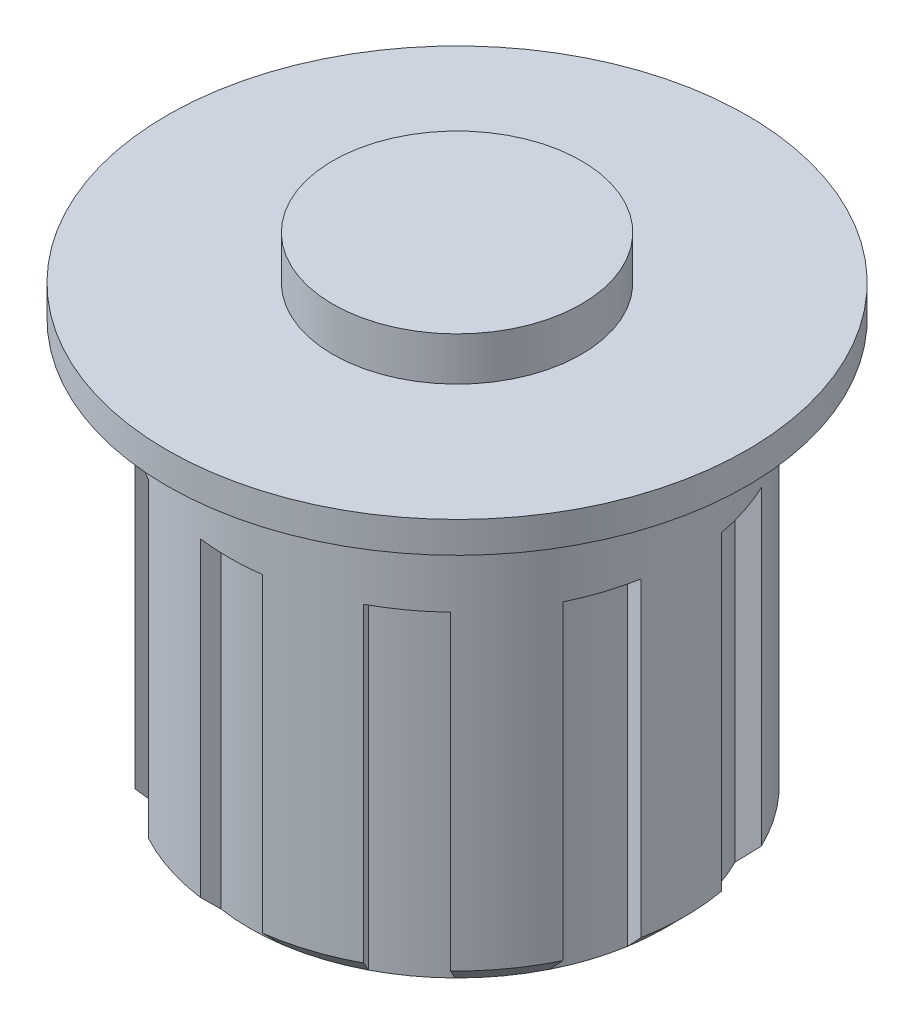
ISO-10303-21;
HEADER;
FILE_DESCRIPTION(('STEP AP214'),'2;1');
FILE_NAME('part.step','',(''),(''),'','','');
FILE_SCHEMA(('AUTOMOTIVE_DESIGN { 1 0 10303 214 1 1 1 1 }'));
ENDSEC;
DATA;
#1=APPLICATION_CONTEXT('core data for automotive mechanical design processes');
#2=APPLICATION_PROTOCOL_DEFINITION('international standard','automotive_design',2000,#1);
#3=PRODUCT_CONTEXT('',#1,'mechanical');
#4=PRODUCT('Part','Part','',(#3));
#5=PRODUCT_RELATED_PRODUCT_CATEGORY('part','',(#4));
#6=PRODUCT_DEFINITION_FORMATION('','',#4);
#7=PRODUCT_DEFINITION_CONTEXT('part definition',#1,'design');
#8=PRODUCT_DEFINITION('design','',#6,#7);
#9=PRODUCT_DEFINITION_SHAPE('','',#8);
#10=(LENGTH_UNIT() NAMED_UNIT(*) SI_UNIT(.MILLI.,.METRE.));
#11=(NAMED_UNIT(*) PLANE_ANGLE_UNIT() SI_UNIT($,.RADIAN.));
#12=(NAMED_UNIT(*) SI_UNIT($,.STERADIAN.) SOLID_ANGLE_UNIT());
#13=UNCERTAINTY_MEASURE_WITH_UNIT(LENGTH_MEASURE(1.E-05),#10,'distance_accuracy_value','');
#14=(GEOMETRIC_REPRESENTATION_CONTEXT(3) GLOBAL_UNCERTAINTY_ASSIGNED_CONTEXT((#13)) GLOBAL_UNIT_ASSIGNED_CONTEXT((#10,
#11,#12)) REPRESENTATION_CONTEXT('',''));
#15=CARTESIAN_POINT('',(0.,0.,0.));
#16=DIRECTION('',(0.,0.,1.));
#17=DIRECTION('',(1.,0.,0.));
#18=AXIS2_PLACEMENT_3D('',#15,#16,#17);
#19=CARTESIAN_POINT('',(0.,-23.1,0.));
#20=DIRECTION('',(0.,1.,0.));
#21=DIRECTION('',(0.,0.,1.));
#22=AXIS2_PLACEMENT_3D('',#19,#20,#21);
#23=CONICAL_SURFACE('',#22,11.,0.785398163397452);
#24=CARTESIAN_POINT('',(7.02475706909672,-24.1002,7.11679620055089));
#25=CARTESIAN_POINT('',(7.12382721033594,-23.9335504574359,7.2531545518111));
#26=CARTESIAN_POINT('',(7.22287297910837,-23.7668590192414,7.38947935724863));
#27=CARTESIAN_POINT('',(7.42091577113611,-23.4333923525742,7.66206187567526));
#28=CARTESIAN_POINT('',(7.51991279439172,-23.266617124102,7.79831958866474));
#29=CARTESIAN_POINT('',(7.61888544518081,-23.0998,7.93454375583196));
#30=B_SPLINE_CURVE_WITH_KNOTS('',3,(#24,#25,#26,#27,#28,#29),.UNSPECIFIED.,.F.,.F.,(4,2,4),(0.,
0.71107311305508,1.42214622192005),.UNSPECIFIED.);
#31=CARTESIAN_POINT('',(7.02487597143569,-24.1,7.11695985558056));
#32=VERTEX_POINT('',#31);
#33=CARTESIAN_POINT('',(7.61876677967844,-23.1,7.93438042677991));
#34=VERTEX_POINT('',#33);
#35=EDGE_CURVE('E11',#32,#34,#30,.T.);
#36=ORIENTED_EDGE('',*,*,#35,.F.);
#37=CARTESIAN_POINT('',(0.,-24.1,0.));
#38=DIRECTION('',(0.,-1.,0.));
#39=DIRECTION('',(0.,0.,-1.));
#40=AXIS2_PLACEMENT_3D('',#37,#38,#39);
#41=CIRCLE('',#40,9.99999999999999);
#42=CARTESIAN_POINT('',(8.93943710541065,-24.1,4.48179252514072));
#43=VERTEX_POINT('',#42);
#44=EDGE_CURVE('E712',#43,#32,#41,.T.);
#45=ORIENTED_EDGE('',*,*,#44,.F.);
#46=CARTESIAN_POINT('',(9.90057261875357,-23.0997916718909,4.79408438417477));
#47=CARTESIAN_POINT('',(9.90056995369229,-23.0997944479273,4.79408351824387));
#48=CARTESIAN_POINT('',(9.900567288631,-23.0997972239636,4.79408265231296));
#49=CARTESIAN_POINT('',(9.58027518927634,-23.4334265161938,4.69001344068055));
#50=CARTESIAN_POINT('',(9.25985036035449,-23.7669094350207,4.58590110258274));
#51=CARTESIAN_POINT('',(8.93924218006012,-24.1002026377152,4.48172919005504));
#52=CARTESIAN_POINT('',(8.93923964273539,-24.1002052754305,4.48172836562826));
#53=CARTESIAN_POINT('',(8.93923710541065,-24.1002079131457,4.48172754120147));
#54=B_SPLINE_CURVE_WITH_KNOTS('',3,(#46,#47,#48,#49,#50,#51,#52,#53),.UNSPECIFIED.,.F.,.F.,(4,2,
2,4),(0.,1.18333804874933E-05,1.42215801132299,1.422169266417),.UNSPECIFIED.);
#55=CARTESIAN_POINT('',(9.90037261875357,-23.1,4.79401940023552));
#56=VERTEX_POINT('',#55);
#57=EDGE_CURVE('E1324',#56,#43,#54,.T.);
#58=ORIENTED_EDGE('',*,*,#57,.F.);
#59=CARTESIAN_POINT('',(0.,-23.1,0.));
#60=DIRECTION('',(0.,-1.,0.));
#61=DIRECTION('',(0.,0.,-1.));
#62=AXIS2_PLACEMENT_3D('',#59,#60,#61);
#63=CIRCLE('',#62,11.);
#64=EDGE_CURVE('E571',#34,#56,#63,.F.);
#65=ORIENTED_EDGE('',*,*,#64,.F.);
#66=EDGE_LOOP('',(#36,#45,#58,#65));
#67=FACE_BOUND('',#66,.T.);
#68=ADVANCED_FACE('F32',(#67),#23,.T.);
#69=CARTESIAN_POINT('',(9.86628808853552,-24.1002079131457,1.62855799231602));
#70=CARTESIAN_POINT('',(9.86629062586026,-24.1002052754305,1.62855881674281));
#71=CARTESIAN_POINT('',(9.866293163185,-24.1002026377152,1.62855964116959));
#72=CARTESIAN_POINT('',(10.1869013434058,-23.766909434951,1.73273155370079));
#73=CARTESIAN_POINT('',(10.5073261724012,-23.4334265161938,1.8368438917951));
#74=CARTESIAN_POINT('',(10.8276182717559,-23.0997972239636,1.94091310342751));
#75=CARTESIAN_POINT('',(10.8276209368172,-23.0997944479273,1.94091396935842));
#76=CARTESIAN_POINT('',(10.8276236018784,-23.0997916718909,1.94091483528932));
#77=B_SPLINE_CURVE_WITH_KNOTS('',3,(#69,#70,#71,#72,#73,#74,#75,#76),.UNSPECIFIED.,.F.,.F.,(4,2,
2,4),(0.,1.1255094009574E-05,1.42215743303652,1.422169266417),.UNSPECIFIED.);
#78=CARTESIAN_POINT('',(9.86648808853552,-24.1,1.62862297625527));
#79=VERTEX_POINT('',#78);
#80=CARTESIAN_POINT('',(10.8274236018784,-23.1,1.94084985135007));
#81=VERTEX_POINT('',#80);
#82=EDGE_CURVE('E1325',#79,#81,#77,.T.);
#83=ORIENTED_EDGE('',*,*,#82,.F.);
#84=CARTESIAN_POINT('',(9.86648808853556,-24.1,-1.62862297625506));
#85=VERTEX_POINT('',#84);
#86=EDGE_CURVE('E708',#85,#79,#41,.T.);
#87=ORIENTED_EDGE('',*,*,#86,.F.);
#88=CARTESIAN_POINT('',(10.8276236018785,-23.0997916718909,-1.94091483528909));
#89=CARTESIAN_POINT('',(10.8276209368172,-23.0997944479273,-1.94091396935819));
#90=CARTESIAN_POINT('',(10.8276182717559,-23.0997972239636,-1.94091310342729));
#91=CARTESIAN_POINT('',(10.5073261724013,-23.4334265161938,-1.83684389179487));
#92=CARTESIAN_POINT('',(10.1869013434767,-23.7669094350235,-1.73273155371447));
#93=CARTESIAN_POINT('',(9.86629316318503,-24.1002026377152,-1.62855964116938));
#94=CARTESIAN_POINT('',(9.8662906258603,-24.1002052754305,-1.6285588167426));
#95=CARTESIAN_POINT('',(9.86628808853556,-24.1002079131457,-1.62855799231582));
#96=B_SPLINE_CURVE_WITH_KNOTS('',3,(#88,#89,#90,#91,#92,#93,#94,#95),.UNSPECIFIED.,.F.,.F.,(4,2,
2,4),(0.,1.18333804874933E-05,1.42215801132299,1.422169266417),.UNSPECIFIED.);
#97=CARTESIAN_POINT('',(10.8274236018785,-23.1,-1.94084985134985));
#98=VERTEX_POINT('',#97);
#99=EDGE_CURVE('E1329',#98,#85,#96,.T.);
#100=ORIENTED_EDGE('',*,*,#99,.F.);
#101=EDGE_CURVE('E1315',#81,#98,#63,.F.);
#102=ORIENTED_EDGE('',*,*,#101,.F.);
#103=EDGE_LOOP('',(#83,#87,#100,#102));
#104=FACE_BOUND('',#103,.T.);
#105=ADVANCED_FACE('F650',(#104),#23,.T.);
#106=CARTESIAN_POINT('',(8.93923710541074,-24.1002079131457,-4.48172754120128));
#107=CARTESIAN_POINT('',(8.93923964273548,-24.1002052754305,-4.48172836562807));
#108=CARTESIAN_POINT('',(8.93924218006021,-24.1002026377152,-4.48172919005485));
#109=CARTESIAN_POINT('',(9.25985036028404,-23.7669094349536,-4.58590110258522));
#110=CARTESIAN_POINT('',(9.58027518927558,-23.4334265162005,-4.69001344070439));
#111=CARTESIAN_POINT('',(9.9005672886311,-23.0997972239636,-4.79408265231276));
#112=CARTESIAN_POINT('',(9.90056995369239,-23.0997944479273,-4.79408351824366));
#113=CARTESIAN_POINT('',(9.90057261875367,-23.0997916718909,-4.79408438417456));
#114=B_SPLINE_CURVE_WITH_KNOTS('',3,(#106,#107,#108,#109,#110,#111,#112,#113),.UNSPECIFIED.,.F.,
.F.,(4,2,2,4),(0.,1.1255094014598E-05,1.42215743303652,1.422169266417),.UNSPECIFIED.);
#115=CARTESIAN_POINT('',(8.93943710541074,-24.1,-4.48179252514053));
#116=VERTEX_POINT('',#115);
#117=CARTESIAN_POINT('',(9.90037261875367,-23.1,-4.79401940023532));
#118=VERTEX_POINT('',#117);
#119=EDGE_CURVE('E1326',#116,#118,#114,.T.);
#120=ORIENTED_EDGE('',*,*,#119,.F.);
#121=CARTESIAN_POINT('',(7.02487597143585,-24.1,-7.11695985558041));
#122=VERTEX_POINT('',#121);
#123=EDGE_CURVE('E704',#122,#116,#41,.T.);
#124=ORIENTED_EDGE('',*,*,#123,.F.);
#125=CARTESIAN_POINT('',(7.61888544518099,-23.0998,-7.93454375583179));
#126=CARTESIAN_POINT('',(7.51991279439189,-23.266617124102,-7.79831958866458));
#127=CARTESIAN_POINT('',(7.42091577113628,-23.4333923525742,-7.6620618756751));
#128=CARTESIAN_POINT('',(7.22287297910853,-23.7668590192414,-7.38947935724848));
#129=CARTESIAN_POINT('',(7.1238272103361,-23.9335504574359,-7.25315455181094));
#130=CARTESIAN_POINT('',(7.02475706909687,-24.1002,-7.11679620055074));
#131=B_SPLINE_CURVE_WITH_KNOTS('',3,(#125,#126,#127,#128,#129,#130),.UNSPECIFIED.,.F.,.F.,(4,2,
4),(0.,0.711073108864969,1.42214622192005),.UNSPECIFIED.);
#132=CARTESIAN_POINT('',(7.61876677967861,-23.1,-7.93438042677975));
#133=VERTEX_POINT('',#132);
#134=EDGE_CURVE('E1359',#133,#122,#131,.T.);
#135=ORIENTED_EDGE('',*,*,#134,.F.);
#136=EDGE_CURVE('E1312',#118,#133,#63,.F.);
#137=ORIENTED_EDGE('',*,*,#136,.F.);
#138=EDGE_LOOP('',(#120,#124,#135,#137));
#139=FACE_BOUND('',#138,.T.);
#140=ADVANCED_FACE('F655',(#139),#23,.T.);
#141=CARTESIAN_POINT('',(4.59770608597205,-24.1002,-8.88015195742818));
#142=CARTESIAN_POINT('',(4.69677622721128,-23.9335504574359,-9.01651030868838));
#143=CARTESIAN_POINT('',(4.79582199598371,-23.7668590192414,-9.15283511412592));
#144=CARTESIAN_POINT('',(4.99386478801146,-23.4333923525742,-9.42541763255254));
#145=CARTESIAN_POINT('',(5.09286181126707,-23.266617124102,-9.56167534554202));
#146=CARTESIAN_POINT('',(5.19183446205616,-23.0998,-9.69789951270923));
#147=B_SPLINE_CURVE_WITH_KNOTS('',3,(#141,#142,#143,#144,#145,#146),.UNSPECIFIED.,.F.,.F.,(4,2,
4),(0.,0.71107311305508,1.42214622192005),.UNSPECIFIED.);
#148=CARTESIAN_POINT('',(4.59782498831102,-24.1,-8.88031561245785));
#149=VERTEX_POINT('',#148);
#150=CARTESIAN_POINT('',(5.19171579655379,-23.1,-9.69773618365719));
#151=VERTEX_POINT('',#150);
#152=EDGE_CURVE('E1353',#149,#151,#147,.T.);
#153=ORIENTED_EDGE('',*,*,#152,.F.);
#154=CARTESIAN_POINT('',(1.50000000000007,-24.1,-9.88685996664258));
#155=VERTEX_POINT('',#154);
#156=EDGE_CURVE('E700',#155,#149,#41,.T.);
#157=ORIENTED_EDGE('',*,*,#156,.F.);
#158=CARTESIAN_POINT('',(1.50000000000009,-21.7933003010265,-12.2149440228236));
#159=CARTESIAN_POINT('',(1.50000000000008,-22.0944202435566,-11.9115574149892));
#160=CARTESIAN_POINT('',(1.50000000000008,-22.3954609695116,-11.6080921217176));
#161=CARTESIAN_POINT('',(1.50000000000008,-22.9973292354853,-11.0009507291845));
#162=CARTESIAN_POINT('',(1.50000000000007,-23.2981567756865,-10.6972746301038));
#163=CARTESIAN_POINT('',(1.50000000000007,-23.8995445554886,-10.0896575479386));
#164=CARTESIAN_POINT('',(1.50000000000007,-24.2001047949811,-9.78571656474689));
#165=CARTESIAN_POINT('',(1.50000000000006,-24.800865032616,-9.17747830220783));
#166=CARTESIAN_POINT('',(1.50000000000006,-25.1010650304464,-8.87318102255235));
#167=CARTESIAN_POINT('',(1.50000000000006,-25.4010382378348,-8.56866009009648));
#168=B_SPLINE_CURVE_WITH_KNOTS('',3,(#158,#159,#160,#161,#162,#163,#164,#165,#166,#167),
.UNSPECIFIED.,.F.,.F.,(4,2,2,2,4),(0.,1.2823611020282,2.56472110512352,3.84708162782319,
5.12944326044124),.UNSPECIFIED.);
#169=CARTESIAN_POINT('',(1.50000000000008,-23.1,-10.8972473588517));
#170=VERTEX_POINT('',#169);
#171=EDGE_CURVE('E1374',#170,#155,#168,.T.);
#172=ORIENTED_EDGE('',*,*,#171,.F.);
#173=EDGE_CURVE('E1309',#151,#170,#63,.F.);
#174=ORIENTED_EDGE('',*,*,#173,.F.);
#175=EDGE_LOOP('',(#153,#157,#172,#174));
#176=FACE_BOUND('',#175,.T.);
#177=ADVANCED_FACE('F1123',(#176),#23,.T.);
#178=CARTESIAN_POINT('',(-1.49999999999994,-25.4010382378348,-8.5686600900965));
#179=CARTESIAN_POINT('',(-1.49999999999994,-25.1010650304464,-8.87318102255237));
#180=CARTESIAN_POINT('',(-1.49999999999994,-24.800865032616,-9.17747830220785));
#181=CARTESIAN_POINT('',(-1.49999999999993,-24.2001047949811,-9.78571656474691));
#182=CARTESIAN_POINT('',(-1.49999999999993,-23.8995445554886,-10.0896575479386));
#183=CARTESIAN_POINT('',(-1.49999999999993,-23.2981567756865,-10.6972746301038));
#184=CARTESIAN_POINT('',(-1.49999999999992,-22.9973292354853,-11.0009507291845));
#185=CARTESIAN_POINT('',(-1.49999999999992,-22.3954609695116,-11.6080921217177));
#186=CARTESIAN_POINT('',(-1.49999999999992,-22.0944202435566,-11.9115574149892));
#187=CARTESIAN_POINT('',(-1.49999999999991,-21.7933003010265,-12.2149440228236));
#188=B_SPLINE_CURVE_WITH_KNOTS('',3,(#178,#179,#180,#181,#182,#183,#184,#185,#186,#187),
.UNSPECIFIED.,.F.,.F.,(4,2,2,2,4),(0.,1.28236163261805,2.56472215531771,3.84708215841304,
5.12944326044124),.UNSPECIFIED.);
#189=CARTESIAN_POINT('',(-1.49999999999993,-24.1,-9.8868599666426));
#190=VERTEX_POINT('',#189);
#191=CARTESIAN_POINT('',(-1.49999999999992,-23.1,-10.8972473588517));
#192=VERTEX_POINT('',#191);
#193=EDGE_CURVE('E1368',#190,#192,#188,.T.);
#194=ORIENTED_EDGE('',*,*,#193,.F.);
#195=CARTESIAN_POINT('',(-4.5978249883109,-24.1,-8.88031561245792));
#196=VERTEX_POINT('',#195);
#197=EDGE_CURVE('E696',#196,#190,#41,.T.);
#198=ORIENTED_EDGE('',*,*,#197,.F.);
#199=CARTESIAN_POINT('',(-5.19183446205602,-23.0998,-9.69789951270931));
#200=CARTESIAN_POINT('',(-5.09286181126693,-23.266617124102,-9.5616753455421));
#201=CARTESIAN_POINT('',(-4.99386478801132,-23.4333923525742,-9.42541763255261));
#202=CARTESIAN_POINT('',(-4.79582199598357,-23.7668590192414,-9.15283511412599));
#203=CARTESIAN_POINT('',(-4.69677622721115,-23.9335504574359,-9.01651030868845));
#204=CARTESIAN_POINT('',(-4.59770608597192,-24.1002,-8.88015195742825));
#205=B_SPLINE_CURVE_WITH_KNOTS('',3,(#199,#200,#201,#202,#203,#204),.UNSPECIFIED.,.F.,.F.,(4,2,
4),(0.,0.711073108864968,1.42214622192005),.UNSPECIFIED.);
#206=CARTESIAN_POINT('',(-5.19171579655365,-23.1,-9.69773618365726));
#207=VERTEX_POINT('',#206);
#208=EDGE_CURVE('E1254',#207,#196,#205,.T.);
#209=ORIENTED_EDGE('',*,*,#208,.F.);
#210=EDGE_CURVE('E1297',#192,#207,#63,.F.);
#211=ORIENTED_EDGE('',*,*,#210,.F.);
#212=EDGE_LOOP('',(#194,#198,#209,#211));
#213=FACE_BOUND('',#212,.T.);
#214=ADVANCED_FACE('F1131',(#213),#23,.T.);
#215=CARTESIAN_POINT('',(-7.02475706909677,-24.1002,-7.11679620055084));
#216=CARTESIAN_POINT('',(-7.123827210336,-23.9335504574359,-7.25315455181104));
#217=CARTESIAN_POINT('',(-7.22287297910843,-23.7668590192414,-7.38947935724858));
#218=CARTESIAN_POINT('',(-7.42091577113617,-23.4333923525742,-7.66206187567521));
#219=CARTESIAN_POINT('',(-7.51991279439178,-23.266617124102,-7.79831958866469));
#220=CARTESIAN_POINT('',(-7.61888544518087,-23.0998,-7.9345437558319));
#221=B_SPLINE_CURVE_WITH_KNOTS('',3,(#215,#216,#217,#218,#219,#220),.UNSPECIFIED.,.F.,.F.,(4,2,
4),(0.,0.711073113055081,1.42214622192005),.UNSPECIFIED.);
#222=CARTESIAN_POINT('',(-7.02487597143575,-24.1,-7.11695985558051));
#223=VERTEX_POINT('',#222);
#224=CARTESIAN_POINT('',(-7.6187667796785,-23.1,-7.93438042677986));
#225=VERTEX_POINT('',#224);
#226=EDGE_CURVE('E1258',#223,#225,#221,.T.);
#227=ORIENTED_EDGE('',*,*,#226,.F.);
#228=CARTESIAN_POINT('',(-8.93943710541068,-24.1,-4.48179252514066));
#229=VERTEX_POINT('',#228);
#230=EDGE_CURVE('E692',#229,#223,#41,.T.);
#231=ORIENTED_EDGE('',*,*,#230,.F.);
#232=CARTESIAN_POINT('',(-9.90057261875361,-23.0997916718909,-4.7940843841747));
#233=CARTESIAN_POINT('',(-9.90056995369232,-23.0997944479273,-4.7940835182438));
#234=CARTESIAN_POINT('',(-9.90056728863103,-23.0997972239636,-4.7940826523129));
#235=CARTESIAN_POINT('',(-9.58027518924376,-23.4334265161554,-4.69001344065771));
#236=CARTESIAN_POINT('',(-9.25985036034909,-23.7669094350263,-4.58590110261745));
#237=CARTESIAN_POINT('',(-8.93924218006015,-24.1002026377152,-4.48172919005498));
#238=CARTESIAN_POINT('',(-8.93923964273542,-24.1002052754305,-4.48172836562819));
#239=CARTESIAN_POINT('',(-8.93923710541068,-24.1002079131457,-4.48172754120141));
#240=B_SPLINE_CURVE_WITH_KNOTS('',3,(#232,#233,#234,#235,#236,#237,#238,#239),.UNSPECIFIED.,.F.,
.F.,(4,2,2,4),(0.,1.18333804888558E-05,1.42215801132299,1.422169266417),.UNSPECIFIED.);
#241=CARTESIAN_POINT('',(-9.90037261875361,-23.1,-4.79401940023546));
#242=VERTEX_POINT('',#241);
#243=EDGE_CURVE('E1255',#242,#229,#240,.T.);
#244=ORIENTED_EDGE('',*,*,#243,.F.);
#245=EDGE_CURVE('E1295',#225,#242,#63,.F.);
#246=ORIENTED_EDGE('',*,*,#245,.F.);
#247=EDGE_LOOP('',(#227,#231,#244,#246));
#248=FACE_BOUND('',#247,.T.);
#249=ADVANCED_FACE('F1139',(#248),#23,.T.);
#250=CARTESIAN_POINT('',(-9.86628808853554,-24.1002079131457,-1.62855799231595));
#251=CARTESIAN_POINT('',(-9.86629062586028,-24.1002052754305,-1.62855881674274));
#252=CARTESIAN_POINT('',(-9.86629316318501,-24.1002026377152,-1.62855964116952));
#253=CARTESIAN_POINT('',(-10.1869013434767,-23.7669094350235,-1.73273155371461));
#254=CARTESIAN_POINT('',(-10.5073261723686,-23.4334265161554,-1.83684389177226));
#255=CARTESIAN_POINT('',(-10.8276182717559,-23.0997972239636,-1.94091310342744));
#256=CARTESIAN_POINT('',(-10.8276209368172,-23.0997944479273,-1.94091396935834));
#257=CARTESIAN_POINT('',(-10.8276236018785,-23.0997916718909,-1.94091483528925));
#258=B_SPLINE_CURVE_WITH_KNOTS('',3,(#250,#251,#252,#253,#254,#255,#256,#257),.UNSPECIFIED.,.F.,
.F.,(4,2,2,4),(0.,1.12550940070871E-05,1.42215743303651,1.422169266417),.UNSPECIFIED.);
#259=CARTESIAN_POINT('',(-9.86648808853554,-24.1,-1.6286229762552));
#260=VERTEX_POINT('',#259);
#261=CARTESIAN_POINT('',(-10.8274236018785,-23.1,-1.94084985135));
#262=VERTEX_POINT('',#261);
#263=EDGE_CURVE('E1251',#260,#262,#258,.T.);
#264=ORIENTED_EDGE('',*,*,#263,.F.);
#265=CARTESIAN_POINT('',(-9.86648808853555,-24.1,1.62862297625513));
#266=VERTEX_POINT('',#265);
#267=EDGE_CURVE('E688',#266,#260,#41,.T.);
#268=ORIENTED_EDGE('',*,*,#267,.F.);
#269=CARTESIAN_POINT('',(-10.8276236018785,-23.0997916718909,1.94091483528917));
#270=CARTESIAN_POINT('',(-10.8276209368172,-23.0997944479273,1.94091396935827));
#271=CARTESIAN_POINT('',(-10.8276182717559,-23.0997972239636,1.94091310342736));
#272=CARTESIAN_POINT('',(-10.5073261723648,-23.4334265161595,1.83684389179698));
#273=CARTESIAN_POINT('',(-10.186901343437,-23.7669094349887,1.73273155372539));
#274=CARTESIAN_POINT('',(-9.86629316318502,-24.1002026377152,1.62855964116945));
#275=CARTESIAN_POINT('',(-9.86629062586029,-24.1002052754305,1.62855881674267));
#276=CARTESIAN_POINT('',(-9.86628808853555,-24.1002079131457,1.62855799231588));
#277=B_SPLINE_CURVE_WITH_KNOTS('',3,(#269,#270,#271,#272,#273,#274,#275,#276),.UNSPECIFIED.,.F.,
.F.,(4,2,2,4),(0.,1.1833380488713E-05,1.42215801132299,1.422169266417),.UNSPECIFIED.);
#278=CARTESIAN_POINT('',(-10.8274236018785,-23.1,1.94084985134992));
#279=VERTEX_POINT('',#278);
#280=EDGE_CURVE('E680',#279,#266,#277,.T.);
#281=ORIENTED_EDGE('',*,*,#280,.F.);
#282=EDGE_CURVE('E1253',#262,#279,#63,.F.);
#283=ORIENTED_EDGE('',*,*,#282,.F.);
#284=EDGE_LOOP('',(#264,#268,#281,#283));
#285=FACE_BOUND('',#284,.T.);
#286=ADVANCED_FACE('F671',(#285),#23,.T.);
#287=CARTESIAN_POINT('',(-8.93923710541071,-24.1002079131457,4.48172754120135));
#288=CARTESIAN_POINT('',(-8.93923964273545,-24.1002052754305,4.48172836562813));
#289=CARTESIAN_POINT('',(-8.93924218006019,-24.1002026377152,4.48172919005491));
#290=CARTESIAN_POINT('',(-9.25985036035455,-23.7669094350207,4.58590110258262));
#291=CARTESIAN_POINT('',(-9.58027518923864,-23.4334265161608,4.69001344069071));
#292=CARTESIAN_POINT('',(-9.90056728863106,-23.0997972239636,4.79408265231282));
#293=CARTESIAN_POINT('',(-9.90056995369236,-23.0997944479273,4.79408351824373));
#294=CARTESIAN_POINT('',(-9.90057261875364,-23.0997916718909,4.79408438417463));
#295=B_SPLINE_CURVE_WITH_KNOTS('',3,(#287,#288,#289,#290,#291,#292,#293,#294),.UNSPECIFIED.,.F.,
.F.,(4,2,2,4),(0.,1.12550940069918E-05,1.42215743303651,1.422169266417),.UNSPECIFIED.);
#296=CARTESIAN_POINT('',(-8.93943710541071,-24.1,4.48179252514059));
#297=VERTEX_POINT('',#296);
#298=CARTESIAN_POINT('',(-9.90037261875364,-23.1,4.79401940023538));
#299=VERTEX_POINT('',#298);
#300=EDGE_CURVE('E1261',#297,#299,#295,.T.);
#301=ORIENTED_EDGE('',*,*,#300,.F.);
#302=CARTESIAN_POINT('',(-7.0248759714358,-24.1,7.11695985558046));
#303=VERTEX_POINT('',#302);
#304=EDGE_CURVE('E687',#303,#297,#41,.T.);
#305=ORIENTED_EDGE('',*,*,#304,.F.);
#306=CARTESIAN_POINT('',(-7.61888544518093,-23.0998,7.93454375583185));
#307=CARTESIAN_POINT('',(-7.51991279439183,-23.266617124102,7.79831958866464));
#308=CARTESIAN_POINT('',(-7.42091577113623,-23.4333923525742,7.66206187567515));
#309=CARTESIAN_POINT('',(-7.22287297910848,-23.7668590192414,7.38947935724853));
#310=CARTESIAN_POINT('',(-7.12382721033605,-23.9335504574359,7.25315455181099));
#311=CARTESIAN_POINT('',(-7.02475706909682,-24.1002,7.11679620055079));
#312=B_SPLINE_CURVE_WITH_KNOTS('',3,(#306,#307,#308,#309,#310,#311),.UNSPECIFIED.,.F.,.F.,(4,2,
4),(0.,0.711073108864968,1.42214622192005),.UNSPECIFIED.);
#313=CARTESIAN_POINT('',(-7.61876677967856,-23.1,7.9343804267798));
#314=VERTEX_POINT('',#313);
#315=EDGE_CURVE('E681',#314,#303,#312,.T.);
#316=ORIENTED_EDGE('',*,*,#315,.F.);
#317=EDGE_CURVE('E1296',#299,#314,#63,.F.);
#318=ORIENTED_EDGE('',*,*,#317,.F.);
#319=EDGE_LOOP('',(#301,#305,#316,#318));
#320=FACE_BOUND('',#319,.T.);
#321=ADVANCED_FACE('F666',(#320),#23,.T.);
#322=CARTESIAN_POINT('',(-4.59770608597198,-24.1002,8.88015195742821));
#323=CARTESIAN_POINT('',(-4.69677622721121,-23.9335504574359,9.01651030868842));
#324=CARTESIAN_POINT('',(-4.79582199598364,-23.7668590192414,9.15283511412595));
#325=CARTESIAN_POINT('',(-4.99386478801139,-23.4333923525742,9.42541763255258));
#326=CARTESIAN_POINT('',(-5.09286181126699,-23.266617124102,9.56167534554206));
#327=CARTESIAN_POINT('',(-5.19183446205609,-23.0998,9.69789951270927));
#328=B_SPLINE_CURVE_WITH_KNOTS('',3,(#322,#323,#324,#325,#326,#327),.UNSPECIFIED.,.F.,.F.,(4,2,
4),(0.,0.71107311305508,1.42214622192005),.UNSPECIFIED.);
#329=CARTESIAN_POINT('',(-4.59782498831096,-24.1,8.88031561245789));
#330=VERTEX_POINT('',#329);
#331=CARTESIAN_POINT('',(-5.19171579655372,-23.1,9.69773618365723));
#332=VERTEX_POINT('',#331);
#333=EDGE_CURVE('E676',#330,#332,#328,.T.);
#334=ORIENTED_EDGE('',*,*,#333,.F.);
#335=CARTESIAN_POINT('',(-1.5,-24.1,9.88685996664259));
#336=VERTEX_POINT('',#335);
#337=EDGE_CURVE('E579',#336,#330,#41,.T.);
#338=ORIENTED_EDGE('',*,*,#337,.F.);
#339=CARTESIAN_POINT('',(-1.5,-22.1700713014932,11.8352523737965));
#340=CARTESIAN_POINT('',(-1.5,-22.4711174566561,11.531792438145));
#341=CARTESIAN_POINT('',(-1.5,-22.7720769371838,11.2282464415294));
#342=CARTESIAN_POINT('',(-1.5,-23.3737596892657,10.6209210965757));
#343=CARTESIAN_POINT('',(-1.5,-23.6744829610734,10.3171417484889));
#344=CARTESIAN_POINT('',(-1.5,-24.2756312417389,9.70928765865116));
#345=CARTESIAN_POINT('',(-1.5,-24.5760562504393,9.40521291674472));
#346=CARTESIAN_POINT('',(-1.5,-25.1764990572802,8.79666104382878));
#347=CARTESIAN_POINT('',(-1.5,-25.4765168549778,8.49218391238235));
#348=CARTESIAN_POINT('',(-1.5,-25.776276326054,8.18745233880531));
#349=B_SPLINE_CURVE_WITH_KNOTS('',3,(#339,#340,#341,#342,#343,#344,#345,#346,#347,#348),
.UNSPECIFIED.,.F.,.F.,(4,2,2,2,4),(0.,1.28236134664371,2.56472131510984,3.8470819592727,
5.12944399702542),.UNSPECIFIED.);
#350=CARTESIAN_POINT('',(-1.5,-23.1,10.8972473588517));
#351=VERTEX_POINT('',#350);
#352=EDGE_CURVE('E582',#351,#336,#349,.T.);
#353=ORIENTED_EDGE('',*,*,#352,.F.);
#354=EDGE_CURVE('E568',#332,#351,#63,.F.);
#355=ORIENTED_EDGE('',*,*,#354,.F.);
#356=EDGE_LOOP('',(#334,#338,#353,#355));
#357=FACE_BOUND('',#356,.T.);
#358=ADVANCED_FACE('F641',(#357),#23,.T.);
#359=CARTESIAN_POINT('',(0.,-2.1,0.));
#360=DIRECTION('',(0.,1.,0.));
#361=DIRECTION('',(0.,0.,1.));
#362=AXIS2_PLACEMENT_3D('',#359,#360,#361);
#363=CYLINDRICAL_SURFACE('',#362,6.);
#364=CARTESIAN_POINT('',(0.,-2.1,0.));
#365=DIRECTION('',(0.,1.,0.));
#366=DIRECTION('',(0.,0.,1.));
#367=AXIS2_PLACEMENT_3D('',#364,#365,#366);
#368=CIRCLE('',#367,6.);
#369=CARTESIAN_POINT('',(0.,-2.1,6.));
#370=VERTEX_POINT('',#369);
#371=EDGE_CURVE('E556',#370,#370,#368,.F.);
#372=ORIENTED_EDGE('',*,*,#371,.F.);
#373=EDGE_LOOP('',(#372));
#374=FACE_BOUND('',#373,.T.);
#375=CARTESIAN_POINT('',(0.,0.,0.));
#376=DIRECTION('',(0.,1.,0.));
#377=DIRECTION('',(0.,0.,1.));
#378=AXIS2_PLACEMENT_3D('',#375,#376,#377);
#379=CIRCLE('',#378,6.);
#380=CARTESIAN_POINT('',(0.,0.,6.));
#381=VERTEX_POINT('',#380);
#382=EDGE_CURVE('E559',#381,#381,#379,.T.);
#383=ORIENTED_EDGE('',*,*,#382,.F.);
#384=EDGE_LOOP('',(#383));
#385=FACE_BOUND('',#384,.T.);
#386=ADVANCED_FACE('F638',(#374,#385),#363,.T.);
#387=CARTESIAN_POINT('',(0.,0.,0.));
#388=DIRECTION('',(0.,1.,0.));
#389=DIRECTION('',(0.,0.,1.));
#390=AXIS2_PLACEMENT_3D('',#387,#388,#389);
#391=PLANE('',#390);
#392=ORIENTED_EDGE('',*,*,#382,.T.);
#393=EDGE_LOOP('',(#392));
#394=FACE_BOUND('',#393,.T.);
#395=ADVANCED_FACE('F634',(#394),#391,.T.);
#396=CARTESIAN_POINT('',(0.,-2.1,0.));
#397=DIRECTION('',(0.,1.,0.));
#398=DIRECTION('',(0.,0.,1.));
#399=AXIS2_PLACEMENT_3D('',#396,#397,#398);
#400=PLANE('',#399);
#401=ORIENTED_EDGE('',*,*,#371,.T.);
#402=EDGE_LOOP('',(#401));
#403=FACE_BOUND('',#402,.T.);
#404=CARTESIAN_POINT('',(0.,-2.1,0.));
#405=DIRECTION('',(0.,1.,0.));
#406=DIRECTION('',(0.,0.,1.));
#407=AXIS2_PLACEMENT_3D('',#404,#405,#406);
#408=CIRCLE('',#407,14.);
#409=CARTESIAN_POINT('',(0.,-2.1,14.));
#410=VERTEX_POINT('',#409);
#411=EDGE_CURVE('E553',#410,#410,#408,.T.);
#412=ORIENTED_EDGE('',*,*,#411,.T.);
#413=EDGE_LOOP('',(#412));
#414=FACE_BOUND('',#413,.T.);
#415=ADVANCED_FACE('F630',(#403,#414),#400,.T.);
#416=CARTESIAN_POINT('',(0.,0.,0.));
#417=DIRECTION('',(0.,1.,0.));
#418=DIRECTION('',(0.,0.,1.));
#419=AXIS2_PLACEMENT_3D('',#416,#417,#418);
#420=CYLINDRICAL_SURFACE('',#419,14.);
#421=CARTESIAN_POINT('',(0.,-3.6,0.));
#422=DIRECTION('',(0.,1.,0.));
#423=DIRECTION('',(0.,0.,1.));
#424=AXIS2_PLACEMENT_3D('',#421,#422,#423);
#425=CIRCLE('',#424,14.);
#426=CARTESIAN_POINT('',(0.,-3.6,14.));
#427=VERTEX_POINT('',#426);
#428=EDGE_CURVE('E550',#427,#427,#425,.T.);
#429=ORIENTED_EDGE('',*,*,#428,.T.);
#430=EDGE_LOOP('',(#429));
#431=FACE_BOUND('',#430,.T.);
#432=ORIENTED_EDGE('',*,*,#411,.F.);
#433=EDGE_LOOP('',(#432));
#434=FACE_BOUND('',#433,.T.);
#435=ADVANCED_FACE('F626',(#431,#434),#420,.T.);
#436=CARTESIAN_POINT('',(0.,-3.6,0.));
#437=DIRECTION('',(0.,1.,0.));
#438=DIRECTION('',(0.,0.,1.));
#439=AXIS2_PLACEMENT_3D('',#436,#437,#438);
#440=CONICAL_SURFACE('',#439,14.,1.39626340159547);
#441=CARTESIAN_POINT('',(0.,-3.98327282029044,0.));
#442=DIRECTION('',(0.,1.,0.));
#443=DIRECTION('',(0.,0.,1.));
#444=AXIS2_PLACEMENT_3D('',#441,#442,#443);
#445=CIRCLE('',#444,11.8263518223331);
#446=CARTESIAN_POINT('',(0.,-3.98327282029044,11.8263518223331));
#447=VERTEX_POINT('',#446);
#448=EDGE_CURVE('E562',#447,#447,#445,.T.);
#449=ORIENTED_EDGE('',*,*,#448,.T.);
#450=EDGE_LOOP('',(#449));
#451=FACE_BOUND('',#450,.T.);
#452=ORIENTED_EDGE('',*,*,#428,.F.);
#453=EDGE_LOOP('',(#452));
#454=FACE_BOUND('',#453,.T.);
#455=ADVANCED_FACE('F623',(#451,#454),#440,.T.);
#456=CARTESIAN_POINT('',(0.,0.,0.));
#457=DIRECTION('',(0.,1.,0.));
#458=DIRECTION('',(0.,0.,1.));
#459=AXIS2_PLACEMENT_3D('',#456,#457,#458);
#460=CYLINDRICAL_SURFACE('',#459,11.);
#461=DIRECTION('',(0.,-1.,0.));
#462=VECTOR('',#461,1.);
#463=CARTESIAN_POINT('',(7.61876677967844,-8.1,7.93438042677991));
#464=LINE('',#463,#462);
#465=CARTESIAN_POINT('',(7.61876677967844,-8.1,7.93438042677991));
#466=VERTEX_POINT('',#465);
#467=EDGE_CURVE('E341',#466,#34,#464,.T.);
#468=ORIENTED_EDGE('',*,*,#467,.T.);
#469=ORIENTED_EDGE('',*,*,#64,.T.);
#470=DIRECTION('',(0.,-1.,0.));
#471=VECTOR('',#470,1.);
#472=CARTESIAN_POINT('',(9.90037261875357,-8.1,4.79401940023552));
#473=LINE('',#472,#471);
#474=CARTESIAN_POINT('',(9.90037261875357,-8.1,4.79401940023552));
#475=VERTEX_POINT('',#474);
#476=EDGE_CURVE('E339',#475,#56,#473,.T.);
#477=ORIENTED_EDGE('',*,*,#476,.F.);
#478=CARTESIAN_POINT('',(0.,-8.1,0.));
#479=DIRECTION('',(0.,-1.,0.));
#480=DIRECTION('',(-0.95105651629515,0.,-0.309016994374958));
#481=AXIS2_PLACEMENT_3D('',#478,#479,#480);
#482=CIRCLE('',#481,11.);
#483=CARTESIAN_POINT('',(10.8274236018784,-8.1,1.94084985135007));
#484=VERTEX_POINT('',#483);
#485=EDGE_CURVE('E326',#484,#475,#482,.T.);
#486=ORIENTED_EDGE('',*,*,#485,.F.);
#487=DIRECTION('',(0.,-1.,0.));
#488=VECTOR('',#487,1.);
#489=CARTESIAN_POINT('',(10.8274236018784,-8.1,1.94084985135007));
#490=LINE('',#489,#488);
#491=EDGE_CURVE('E342',#484,#81,#490,.T.);
#492=ORIENTED_EDGE('',*,*,#491,.T.);
#493=ORIENTED_EDGE('',*,*,#101,.T.);
#494=DIRECTION('',(0.,-1.,0.));
#495=VECTOR('',#494,1.);
#496=CARTESIAN_POINT('',(10.8274236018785,-8.1,-1.94084985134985));
#497=LINE('',#496,#495);
#498=CARTESIAN_POINT('',(10.8274236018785,-8.1,-1.94084985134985));
#499=VERTEX_POINT('',#498);
#500=EDGE_CURVE('E363',#499,#98,#497,.T.);
#501=ORIENTED_EDGE('',*,*,#500,.F.);
#502=CARTESIAN_POINT('',(0.,-8.1,0.));
#503=DIRECTION('',(0.,-1.,0.));
#504=DIRECTION('',(-0.951056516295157,0.,0.309016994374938));
#505=AXIS2_PLACEMENT_3D('',#502,#503,#504);
#506=CIRCLE('',#505,11.);
#507=CARTESIAN_POINT('',(9.90037261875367,-8.1,-4.79401940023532));
#508=VERTEX_POINT('',#507);
#509=EDGE_CURVE('E351',#508,#499,#506,.T.);
#510=ORIENTED_EDGE('',*,*,#509,.F.);
#511=DIRECTION('',(0.,-1.,0.));
#512=VECTOR('',#511,1.);
#513=CARTESIAN_POINT('',(9.90037261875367,-8.1,-4.79401940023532));
#514=LINE('',#513,#512);
#515=EDGE_CURVE('E366',#508,#118,#514,.T.);
#516=ORIENTED_EDGE('',*,*,#515,.T.);
#517=ORIENTED_EDGE('',*,*,#136,.T.);
#518=DIRECTION('',(0.,-1.,0.));
#519=VECTOR('',#518,1.);
#520=CARTESIAN_POINT('',(7.61876677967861,-8.1,-7.93438042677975));
#521=LINE('',#520,#519);
#522=CARTESIAN_POINT('',(7.61876677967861,-8.1,-7.93438042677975));
#523=VERTEX_POINT('',#522);
#524=EDGE_CURVE('E388',#523,#133,#521,.T.);
#525=ORIENTED_EDGE('',*,*,#524,.F.);
#526=CARTESIAN_POINT('',(0.,-8.1,0.));
#527=DIRECTION('',(0.,-1.,0.));
#528=DIRECTION('',(-0.58778525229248,0.,0.809016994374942));
#529=AXIS2_PLACEMENT_3D('',#526,#527,#528);
#530=CIRCLE('',#529,11.);
#531=CARTESIAN_POINT('',(5.19171579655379,-8.1,-9.69773618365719));
#532=VERTEX_POINT('',#531);
#533=EDGE_CURVE('E376',#532,#523,#530,.T.);
#534=ORIENTED_EDGE('',*,*,#533,.F.);
#535=DIRECTION('',(0.,-1.,0.));
#536=VECTOR('',#535,1.);
#537=CARTESIAN_POINT('',(5.19171579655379,-8.1,-9.69773618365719));
#538=LINE('',#537,#536);
#539=EDGE_CURVE('E391',#532,#151,#538,.T.);
#540=ORIENTED_EDGE('',*,*,#539,.T.);
#541=ORIENTED_EDGE('',*,*,#173,.T.);
#542=DIRECTION('',(0.,-1.,0.));
#543=VECTOR('',#542,1.);
#544=CARTESIAN_POINT('',(1.50000000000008,-8.1,-10.8972473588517));
#545=LINE('',#544,#543);
#546=CARTESIAN_POINT('',(1.50000000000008,-8.1,-10.8972473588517));
#547=VERTEX_POINT('',#546);
#548=EDGE_CURVE('E413',#547,#170,#545,.T.);
#549=ORIENTED_EDGE('',*,*,#548,.F.);
#550=CARTESIAN_POINT('',(0.,-8.1,0.));
#551=DIRECTION('',(0.,-1.,0.));
#552=DIRECTION('',(0.,0.,1.));
#553=AXIS2_PLACEMENT_3D('',#550,#551,#552);
#554=CIRCLE('',#553,11.);
#555=CARTESIAN_POINT('',(-1.49999999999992,-8.1,-10.8972473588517));
#556=VERTEX_POINT('',#555);
#557=EDGE_CURVE('E401',#556,#547,#554,.T.);
#558=ORIENTED_EDGE('',*,*,#557,.F.);
#559=DIRECTION('',(0.,-1.,0.));
#560=VECTOR('',#559,1.);
#561=CARTESIAN_POINT('',(-1.49999999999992,-8.1,-10.8972473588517));
#562=LINE('',#561,#560);
#563=EDGE_CURVE('E416',#556,#192,#562,.T.);
#564=ORIENTED_EDGE('',*,*,#563,.T.);
#565=ORIENTED_EDGE('',*,*,#210,.T.);
#566=DIRECTION('',(0.,-1.,0.));
#567=VECTOR('',#566,1.);
#568=CARTESIAN_POINT('',(-5.19171579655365,-8.1,-9.69773618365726));
#569=LINE('',#568,#567);
#570=CARTESIAN_POINT('',(-5.19171579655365,-8.1,-9.69773618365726));
#571=VERTEX_POINT('',#570);
#572=EDGE_CURVE('E438',#571,#207,#569,.T.);
#573=ORIENTED_EDGE('',*,*,#572,.F.);
#574=CARTESIAN_POINT('',(0.,-8.1,0.));
#575=DIRECTION('',(0.,-1.,0.));
#576=DIRECTION('',(0.587785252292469,0.,0.809016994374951));
#577=AXIS2_PLACEMENT_3D('',#574,#575,#576);
#578=CIRCLE('',#577,11.);
#579=CARTESIAN_POINT('',(-7.6187667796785,-8.1,-7.93438042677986));
#580=VERTEX_POINT('',#579);
#581=EDGE_CURVE('E426',#580,#571,#578,.T.);
#582=ORIENTED_EDGE('',*,*,#581,.F.);
#583=DIRECTION('',(0.,-1.,0.));
#584=VECTOR('',#583,1.);
#585=CARTESIAN_POINT('',(-7.6187667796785,-8.1,-7.93438042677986));
#586=LINE('',#585,#584);
#587=EDGE_CURVE('E441',#580,#225,#586,.T.);
#588=ORIENTED_EDGE('',*,*,#587,.T.);
#589=ORIENTED_EDGE('',*,*,#245,.T.);
#590=DIRECTION('',(0.,-1.,0.));
#591=VECTOR('',#590,1.);
#592=CARTESIAN_POINT('',(-9.90037261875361,-8.1,-4.79401940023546));
#593=LINE('',#592,#591);
#594=CARTESIAN_POINT('',(-9.90037261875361,-8.1,-4.79401940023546));
#595=VERTEX_POINT('',#594);
#596=EDGE_CURVE('E463',#595,#242,#593,.T.);
#597=ORIENTED_EDGE('',*,*,#596,.F.);
#598=CARTESIAN_POINT('',(0.,-8.1,0.));
#599=DIRECTION('',(0.,-1.,0.));
#600=DIRECTION('',(0.951056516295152,0.,0.309016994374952));
#601=AXIS2_PLACEMENT_3D('',#598,#599,#600);
#602=CIRCLE('',#601,11.);
#603=CARTESIAN_POINT('',(-10.8274236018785,-8.1,-1.94084985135));
#604=VERTEX_POINT('',#603);
#605=EDGE_CURVE('E451',#604,#595,#602,.T.);
#606=ORIENTED_EDGE('',*,*,#605,.F.);
#607=DIRECTION('',(0.,-1.,0.));
#608=VECTOR('',#607,1.);
#609=CARTESIAN_POINT('',(-10.8274236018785,-8.1,-1.94084985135));
#610=LINE('',#609,#608);
#611=EDGE_CURVE('E466',#604,#262,#610,.T.);
#612=ORIENTED_EDGE('',*,*,#611,.T.);
#613=ORIENTED_EDGE('',*,*,#282,.T.);
#614=DIRECTION('',(0.,-1.,0.));
#615=VECTOR('',#614,1.);
#616=CARTESIAN_POINT('',(-10.8274236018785,-8.1,1.94084985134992));
#617=LINE('',#616,#615);
#618=CARTESIAN_POINT('',(-10.8274236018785,-8.1,1.94084985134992));
#619=VERTEX_POINT('',#618);
#620=EDGE_CURVE('E488',#619,#279,#617,.T.);
#621=ORIENTED_EDGE('',*,*,#620,.F.);
#622=CARTESIAN_POINT('',(0.,-8.1,0.));
#623=DIRECTION('',(0.,-1.,0.));
#624=DIRECTION('',(0.951056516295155,0.,-0.309016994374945));
#625=AXIS2_PLACEMENT_3D('',#622,#623,#624);
#626=CIRCLE('',#625,11.);
#627=CARTESIAN_POINT('',(-9.90037261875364,-8.1,4.79401940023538));
#628=VERTEX_POINT('',#627);
#629=EDGE_CURVE('E476',#628,#619,#626,.T.);
#630=ORIENTED_EDGE('',*,*,#629,.F.);
#631=DIRECTION('',(0.,-1.,0.));
#632=VECTOR('',#631,1.);
#633=CARTESIAN_POINT('',(-9.90037261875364,-8.1,4.79401940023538));
#634=LINE('',#633,#632);
#635=EDGE_CURVE('E491',#628,#299,#634,.T.);
#636=ORIENTED_EDGE('',*,*,#635,.T.);
#637=ORIENTED_EDGE('',*,*,#317,.T.);
#638=DIRECTION('',(0.,-1.,0.));
#639=VECTOR('',#638,1.);
#640=CARTESIAN_POINT('',(-7.61876677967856,-8.1,7.9343804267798));
#641=LINE('',#640,#639);
#642=CARTESIAN_POINT('',(-7.61876677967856,-8.1,7.9343804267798));
#643=VERTEX_POINT('',#642);
#644=EDGE_CURVE('E513',#643,#314,#641,.T.);
#645=ORIENTED_EDGE('',*,*,#644,.F.);
#646=CARTESIAN_POINT('',(0.,-8.1,0.));
#647=DIRECTION('',(0.,-1.,0.));
#648=DIRECTION('',(0.587785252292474,0.,-0.809016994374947));
#649=AXIS2_PLACEMENT_3D('',#646,#647,#648);
#650=CIRCLE('',#649,11.);
#651=CARTESIAN_POINT('',(-5.19171579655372,-8.1,9.69773618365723));
#652=VERTEX_POINT('',#651);
#653=EDGE_CURVE('E501',#652,#643,#650,.T.);
#654=ORIENTED_EDGE('',*,*,#653,.F.);
#655=DIRECTION('',(0.,-1.,0.));
#656=VECTOR('',#655,1.);
#657=CARTESIAN_POINT('',(-5.19171579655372,-8.1,9.69773618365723));
#658=LINE('',#657,#656);
#659=EDGE_CURVE('E516',#652,#332,#658,.T.);
#660=ORIENTED_EDGE('',*,*,#659,.T.);
#661=ORIENTED_EDGE('',*,*,#354,.T.);
#662=DIRECTION('',(0.,-1.,0.));
#663=VECTOR('',#662,1.);
#664=CARTESIAN_POINT('',(-1.5,-8.1,10.8972473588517));
#665=LINE('',#664,#663);
#666=CARTESIAN_POINT('',(-1.5,-8.1,10.8972473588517));
#667=VERTEX_POINT('',#666);
#668=EDGE_CURVE('E537',#667,#351,#665,.T.);
#669=ORIENTED_EDGE('',*,*,#668,.F.);
#670=CARTESIAN_POINT('',(0.,-8.1,0.));
#671=DIRECTION('',(0.,-1.,0.));
#672=DIRECTION('',(0.,0.,-1.));
#673=AXIS2_PLACEMENT_3D('',#670,#671,#672);
#674=CIRCLE('',#673,11.);
#675=CARTESIAN_POINT('',(1.5,-8.1,10.8972473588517));
#676=VERTEX_POINT('',#675);
#677=EDGE_CURVE('E519',#676,#667,#674,.T.);
#678=ORIENTED_EDGE('',*,*,#677,.F.);
#679=DIRECTION('',(0.,-1.,0.));
#680=VECTOR('',#679,1.);
#681=CARTESIAN_POINT('',(1.5,-8.1,10.8972473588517));
#682=LINE('',#681,#680);
#683=CARTESIAN_POINT('',(1.5,-23.1,10.8972473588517));
#684=VERTEX_POINT('',#683);
#685=EDGE_CURVE('E538',#676,#684,#682,.T.);
#686=ORIENTED_EDGE('',*,*,#685,.T.);
#687=CARTESIAN_POINT('',(5.19171579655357,-23.1,9.6977361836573));
#688=VERTEX_POINT('',#687);
#689=EDGE_CURVE('E319',#684,#688,#63,.F.);
#690=ORIENTED_EDGE('',*,*,#689,.T.);
#691=DIRECTION('',(0.,-1.,0.));
#692=VECTOR('',#691,1.);
#693=CARTESIAN_POINT('',(5.19171579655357,-8.1,9.6977361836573));
#694=LINE('',#693,#692);
#695=CARTESIAN_POINT('',(5.19171579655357,-8.1,9.6977361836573));
#696=VERTEX_POINT('',#695);
#697=EDGE_CURVE('E298',#696,#688,#694,.T.);
#698=ORIENTED_EDGE('',*,*,#697,.F.);
#699=CARTESIAN_POINT('',(0.,-8.1,0.));
#700=DIRECTION('',(0.,-1.,0.));
#701=DIRECTION('',(-0.587785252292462,0.,-0.809016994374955));
#702=AXIS2_PLACEMENT_3D('',#699,#700,#701);
#703=CIRCLE('',#702,11.);
#704=EDGE_CURVE('E303',#466,#696,#703,.T.);
#705=ORIENTED_EDGE('',*,*,#704,.F.);
#706=EDGE_LOOP('',(#468,#469,#477,#486,#492,#493,#501,#510,#516,#517,#525,#534,#540,#541,#549,
#558,#564,#565,#573,#582,#588,#589,#597,#606,#612,#613,#621,#630,#636,#637,#645,#654,#660,#661,
#669,#678,#686,#690,#698,#705));
#707=FACE_BOUND('',#706,.T.);
#708=CARTESIAN_POINT('',(0.,-4.96808057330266,0.));
#709=DIRECTION('',(0.,1.,0.));
#710=DIRECTION('',(0.,0.,1.));
#711=AXIS2_PLACEMENT_3D('',#708,#709,#710);
#712=CIRCLE('',#711,11.);
#713=CARTESIAN_POINT('',(0.,-4.96808057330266,11.));
#714=VERTEX_POINT('',#713);
#715=EDGE_CURVE('E565',#714,#714,#712,.F.);
#716=ORIENTED_EDGE('',*,*,#715,.T.);
#717=EDGE_LOOP('',(#716));
#718=FACE_BOUND('',#717,.T.);
#719=ADVANCED_FACE('F315',(#707,#718),#460,.T.);
#720=CARTESIAN_POINT('',(-11.,-24.1,0.));
#721=DIRECTION('',(0.,-1.,0.));
#722=DIRECTION('',(0.,0.,-1.));
#723=AXIS2_PLACEMENT_3D('',#720,#721,#722);
#724=PLANE('',#723);
#725=CARTESIAN_POINT('',(1.5,-24.1,9.88685996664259));
#726=VERTEX_POINT('',#725);
#727=EDGE_CURVE('E575',#726,#336,#41,.T.);
#728=ORIENTED_EDGE('',*,*,#727,.T.);
#729=ORIENTED_EDGE('',*,*,#337,.T.);
#730=CARTESIAN_POINT('',(0.,-24.1,0.));
#731=DIRECTION('',(0.,1.,0.));
#732=DIRECTION('',(0.587785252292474,0.,-0.809016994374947));
#733=AXIS2_PLACEMENT_3D('',#730,#731,#732);
#734=CIRCLE('',#733,10.);
#735=EDGE_CURVE('E494',#303,#330,#734,.T.);
#736=ORIENTED_EDGE('',*,*,#735,.F.);
#737=ORIENTED_EDGE('',*,*,#304,.T.);
#738=CARTESIAN_POINT('',(0.,-24.1,0.));
#739=DIRECTION('',(0.,1.,0.));
#740=DIRECTION('',(0.951056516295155,0.,-0.309016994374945));
#741=AXIS2_PLACEMENT_3D('',#738,#739,#740);
#742=CIRCLE('',#741,10.);
#743=EDGE_CURVE('E469',#266,#297,#742,.T.);
#744=ORIENTED_EDGE('',*,*,#743,.F.);
#745=ORIENTED_EDGE('',*,*,#267,.T.);
#746=CARTESIAN_POINT('',(0.,-24.1,0.));
#747=DIRECTION('',(0.,1.,0.));
#748=DIRECTION('',(0.951056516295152,0.,0.309016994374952));
#749=AXIS2_PLACEMENT_3D('',#746,#747,#748);
#750=CIRCLE('',#749,10.);
#751=EDGE_CURVE('E444',#229,#260,#750,.T.);
#752=ORIENTED_EDGE('',*,*,#751,.F.);
#753=ORIENTED_EDGE('',*,*,#230,.T.);
#754=CARTESIAN_POINT('',(0.,-24.1,0.));
#755=DIRECTION('',(0.,1.,0.));
#756=DIRECTION('',(0.587785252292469,0.,0.809016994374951));
#757=AXIS2_PLACEMENT_3D('',#754,#755,#756);
#758=CIRCLE('',#757,10.);
#759=EDGE_CURVE('E419',#196,#223,#758,.T.);
#760=ORIENTED_EDGE('',*,*,#759,.F.);
#761=ORIENTED_EDGE('',*,*,#197,.T.);
#762=CARTESIAN_POINT('',(0.,-24.1,0.));
#763=DIRECTION('',(0.,1.,0.));
#764=DIRECTION('',(0.,0.,1.));
#765=AXIS2_PLACEMENT_3D('',#762,#763,#764);
#766=CIRCLE('',#765,10.);
#767=EDGE_CURVE('E394',#155,#190,#766,.T.);
#768=ORIENTED_EDGE('',*,*,#767,.F.);
#769=ORIENTED_EDGE('',*,*,#156,.T.);
#770=CARTESIAN_POINT('',(0.,-24.1,0.));
#771=DIRECTION('',(0.,1.,0.));
#772=DIRECTION('',(-0.58778525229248,0.,0.809016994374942));
#773=AXIS2_PLACEMENT_3D('',#770,#771,#772);
#774=CIRCLE('',#773,10.);
#775=EDGE_CURVE('E369',#122,#149,#774,.T.);
#776=ORIENTED_EDGE('',*,*,#775,.F.);
#777=ORIENTED_EDGE('',*,*,#123,.T.);
#778=CARTESIAN_POINT('',(0.,-24.1,0.));
#779=DIRECTION('',(0.,1.,0.));
#780=DIRECTION('',(-0.951056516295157,0.,0.309016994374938));
#781=AXIS2_PLACEMENT_3D('',#778,#779,#780);
#782=CIRCLE('',#781,10.);
#783=EDGE_CURVE('E345',#85,#116,#782,.T.);
#784=ORIENTED_EDGE('',*,*,#783,.F.);
#785=ORIENTED_EDGE('',*,*,#86,.T.);
#786=CARTESIAN_POINT('',(0.,-24.1,0.));
#787=DIRECTION('',(0.,1.,0.));
#788=DIRECTION('',(-0.95105651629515,0.,-0.309016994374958));
#789=AXIS2_PLACEMENT_3D('',#786,#787,#788);
#790=CIRCLE('',#789,10.);
#791=EDGE_CURVE('E330',#43,#79,#790,.T.);
#792=ORIENTED_EDGE('',*,*,#791,.F.);
#793=ORIENTED_EDGE('',*,*,#44,.T.);
#794=CARTESIAN_POINT('',(0.,-24.1,0.));
#795=DIRECTION('',(0.,1.,0.));
#796=DIRECTION('',(-0.587785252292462,0.,-0.809016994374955));
#797=AXIS2_PLACEMENT_3D('',#794,#795,#796);
#798=CIRCLE('',#797,10.);
#799=CARTESIAN_POINT('',(4.59782498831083,-24.1,8.88031561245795));
#800=VERTEX_POINT('',#799);
#801=EDGE_CURVE('E312',#800,#32,#798,.T.);
#802=ORIENTED_EDGE('',*,*,#801,.F.);
#803=EDGE_CURVE('E574',#800,#726,#41,.T.);
#804=ORIENTED_EDGE('',*,*,#803,.T.);
#805=EDGE_LOOP('',(#728,#729,#736,#737,#744,#745,#752,#753,#760,#761,#768,#769,#776,#777,#784,
#785,#792,#793,#802,#804));
#806=FACE_BOUND('',#805,.T.);
#807=CARTESIAN_POINT('',(0.,-24.1,0.));
#808=DIRECTION('',(0.,-1.,0.));
#809=DIRECTION('',(0.,0.,-1.));
#810=AXIS2_PLACEMENT_3D('',#807,#808,#809);
#811=CIRCLE('',#810,6.);
#812=CARTESIAN_POINT('',(0.,-24.1,-6.));
#813=VERTEX_POINT('',#812);
#814=EDGE_CURVE('E570',#813,#813,#811,.F.);
#815=ORIENTED_EDGE('',*,*,#814,.T.);
#816=EDGE_LOOP('',(#815));
#817=FACE_BOUND('',#816,.T.);
#818=ADVANCED_FACE('F617',(#806,#817),#724,.T.);
#819=CARTESIAN_POINT('',(0.,-4.96808057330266,0.));
#820=DIRECTION('',(0.,1.,0.));
#821=DIRECTION('',(0.,0.,1.));
#822=AXIS2_PLACEMENT_3D('',#819,#820,#821);
#823=TOROIDAL_SURFACE('',#822,12.,1.);
#824=ORIENTED_EDGE('',*,*,#715,.F.);
#825=EDGE_LOOP('',(#824));
#826=FACE_BOUND('',#825,.T.);
#827=ORIENTED_EDGE('',*,*,#448,.F.);
#828=EDGE_LOOP('',(#827));
#829=FACE_BOUND('',#828,.T.);
#830=ADVANCED_FACE('F615',(#826,#829),#823,.F.);
#831=CARTESIAN_POINT('',(0.,-9.1,0.));
#832=DIRECTION('',(0.,-1.,0.));
#833=DIRECTION('',(0.,0.,-1.));
#834=AXIS2_PLACEMENT_3D('',#831,#832,#833);
#835=CYLINDRICAL_SURFACE('',#834,5.);
#836=CARTESIAN_POINT('',(0.,-23.1,0.));
#837=DIRECTION('',(0.,-1.,0.));
#838=DIRECTION('',(0.,0.,-1.));
#839=AXIS2_PLACEMENT_3D('',#836,#837,#838);
#840=CIRCLE('',#839,5.);
#841=CARTESIAN_POINT('',(0.,-23.1,-5.));
#842=VERTEX_POINT('',#841);
#843=EDGE_CURVE('E578',#842,#842,#840,.T.);
#844=ORIENTED_EDGE('',*,*,#843,.T.);
#845=EDGE_LOOP('',(#844));
#846=FACE_BOUND('',#845,.T.);
#847=CARTESIAN_POINT('',(0.,-9.1,0.));
#848=DIRECTION('',(0.,-1.,0.));
#849=DIRECTION('',(0.,0.,-1.));
#850=AXIS2_PLACEMENT_3D('',#847,#848,#849);
#851=CIRCLE('',#850,5.);
#852=CARTESIAN_POINT('',(0.,-9.1,-5.));
#853=VERTEX_POINT('',#852);
#854=EDGE_CURVE('E540',#853,#853,#851,.T.);
#855=ORIENTED_EDGE('',*,*,#854,.F.);
#856=EDGE_LOOP('',(#855));
#857=FACE_BOUND('',#856,.T.);
#858=ADVANCED_FACE('F611',(#846,#857),#835,.F.);
#859=CARTESIAN_POINT('',(0.,-9.1,0.));
#860=DIRECTION('',(0.,-1.,0.));
#861=DIRECTION('',(0.,0.,-1.));
#862=AXIS2_PLACEMENT_3D('',#859,#860,#861);
#863=PLANE('',#862);
#864=ORIENTED_EDGE('',*,*,#854,.T.);
#865=EDGE_LOOP('',(#864));
#866=FACE_BOUND('',#865,.T.);
#867=ADVANCED_FACE('F608',(#866),#863,.T.);
#868=CARTESIAN_POINT('',(5.19183446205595,-23.0998,9.69789951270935));
#869=CARTESIAN_POINT('',(5.09286181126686,-23.266617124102,9.56167534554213));
#870=CARTESIAN_POINT('',(4.99386478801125,-23.4333923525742,9.42541763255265));
#871=CARTESIAN_POINT('',(4.79582199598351,-23.7668590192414,9.15283511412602));
#872=CARTESIAN_POINT('',(4.69677622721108,-23.9335504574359,9.01651030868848));
#873=CARTESIAN_POINT('',(4.59770608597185,-24.1002,8.88015195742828));
#874=B_SPLINE_CURVE_WITH_KNOTS('',3,(#868,#869,#870,#871,#872,#873),.UNSPECIFIED.,.F.,.F.,(4,2,
4),(0.,0.711073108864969,1.42214622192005),.UNSPECIFIED.);
#875=EDGE_CURVE('E45',#688,#800,#874,.T.);
#876=ORIENTED_EDGE('',*,*,#875,.F.);
#877=ORIENTED_EDGE('',*,*,#689,.F.);
#878=CARTESIAN_POINT('',(1.5,-25.776276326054,8.18745233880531));
#879=CARTESIAN_POINT('',(1.5,-25.4765168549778,8.49218391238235));
#880=CARTESIAN_POINT('',(1.5,-25.1764990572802,8.79666104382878));
#881=CARTESIAN_POINT('',(1.5,-24.5760562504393,9.40521291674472));
#882=CARTESIAN_POINT('',(1.5,-24.2756312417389,9.70928765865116));
#883=CARTESIAN_POINT('',(1.5,-23.6744829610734,10.3171417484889));
#884=CARTESIAN_POINT('',(1.5,-23.3737596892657,10.6209210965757));
#885=CARTESIAN_POINT('',(1.5,-22.7720769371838,11.2282464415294));
#886=CARTESIAN_POINT('',(1.5,-22.4711174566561,11.531792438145));
#887=CARTESIAN_POINT('',(1.5,-22.1700713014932,11.8352523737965));
#888=B_SPLINE_CURVE_WITH_KNOTS('',3,(#878,#879,#880,#881,#882,#883,#884,#885,#886,#887),
.UNSPECIFIED.,.F.,.F.,(4,2,2,2,4),(0.,1.28236203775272,2.56472268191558,3.84708265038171,
5.12944399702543),.UNSPECIFIED.);
#889=EDGE_CURVE('E590',#726,#684,#888,.T.);
#890=ORIENTED_EDGE('',*,*,#889,.F.);
#891=ORIENTED_EDGE('',*,*,#803,.F.);
#892=EDGE_LOOP('',(#876,#877,#890,#891));
#893=FACE_BOUND('',#892,.T.);
#894=ADVANCED_FACE('F597',(#893),#23,.T.);
#895=CARTESIAN_POINT('',(0.,-23.1,0.));
#896=DIRECTION('',(0.,-1.,0.));
#897=DIRECTION('',(0.,0.,-1.));
#898=AXIS2_PLACEMENT_3D('',#895,#896,#897);
#899=CONICAL_SURFACE('',#898,5.,0.78539816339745);
#900=ORIENTED_EDGE('',*,*,#814,.F.);
#901=EDGE_LOOP('',(#900));
#902=FACE_BOUND('',#901,.T.);
#903=ORIENTED_EDGE('',*,*,#843,.F.);
#904=EDGE_LOOP('',(#903));
#905=FACE_BOUND('',#904,.T.);
#906=ADVANCED_FACE('F34',(#902,#905),#899,.F.);
#907=CARTESIAN_POINT('',(1.5,-8.1,10.8972473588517));
#908=DIRECTION('',(1.,0.,0.));
#909=DIRECTION('',(0.,0.,-1.));
#910=AXIS2_PLACEMENT_3D('',#907,#908,#909);
#911=PLANE('',#910);
#912=ORIENTED_EDGE('',*,*,#889,.T.);
#913=ORIENTED_EDGE('',*,*,#685,.F.);
#914=DIRECTION('',(0.,0.,1.));
#915=VECTOR('',#914,1.);
#916=CARTESIAN_POINT('',(1.5,-8.1,10.8972473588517));
#917=LINE('',#916,#915);
#918=CARTESIAN_POINT('',(1.5,-8.1,9.88685996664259));
#919=VERTEX_POINT('',#918);
#920=EDGE_CURVE('E534',#919,#676,#917,.T.);
#921=ORIENTED_EDGE('',*,*,#920,.F.);
#922=DIRECTION('',(0.,-1.,0.));
#923=VECTOR('',#922,1.);
#924=CARTESIAN_POINT('',(1.5,-8.1,9.88685996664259));
#925=LINE('',#924,#923);
#926=EDGE_CURVE('E541',#919,#726,#925,.T.);
#927=ORIENTED_EDGE('',*,*,#926,.T.);
#928=EDGE_LOOP('',(#912,#913,#921,#927));
#929=FACE_BOUND('',#928,.T.);
#930=ADVANCED_FACE('F663',(#929),#911,.F.);
#931=CARTESIAN_POINT('',(0.,-8.1,0.));
#932=DIRECTION('',(0.,-1.,0.));
#933=DIRECTION('',(0.,0.,-1.));
#934=AXIS2_PLACEMENT_3D('',#931,#932,#933);
#935=CYLINDRICAL_SURFACE('',#934,10.);
#936=ORIENTED_EDGE('',*,*,#727,.F.);
#937=ORIENTED_EDGE('',*,*,#926,.F.);
#938=CARTESIAN_POINT('',(0.,-8.1,0.));
#939=DIRECTION('',(0.,1.,0.));
#940=DIRECTION('',(0.,0.,-1.));
#941=AXIS2_PLACEMENT_3D('',#938,#939,#940);
#942=CIRCLE('',#941,10.);
#943=CARTESIAN_POINT('',(-1.5,-8.1,9.88685996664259));
#944=VERTEX_POINT('',#943);
#945=EDGE_CURVE('E531',#944,#919,#942,.T.);
#946=ORIENTED_EDGE('',*,*,#945,.F.);
#947=DIRECTION('',(0.,-1.,0.));
#948=VECTOR('',#947,1.);
#949=CARTESIAN_POINT('',(-1.5,-8.1,9.88685996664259));
#950=LINE('',#949,#948);
#951=EDGE_CURVE('E544',#944,#336,#950,.T.);
#952=ORIENTED_EDGE('',*,*,#951,.T.);
#953=EDGE_LOOP('',(#936,#937,#946,#952));
#954=FACE_BOUND('',#953,.T.);
#955=ADVANCED_FACE('F606',(#954),#935,.T.);
#956=CARTESIAN_POINT('',(-1.5,-8.1,10.8972473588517));
#957=DIRECTION('',(-1.,0.,0.));
#958=DIRECTION('',(0.,0.,1.));
#959=AXIS2_PLACEMENT_3D('',#956,#957,#958);
#960=PLANE('',#959);
#961=ORIENTED_EDGE('',*,*,#352,.T.);
#962=ORIENTED_EDGE('',*,*,#951,.F.);
#963=DIRECTION('',(0.,0.,-1.));
#964=VECTOR('',#963,1.);
#965=CARTESIAN_POINT('',(-1.5,-8.1,10.8972473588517));
#966=LINE('',#965,#964);
#967=EDGE_CURVE('E528',#667,#944,#966,.T.);
#968=ORIENTED_EDGE('',*,*,#967,.F.);
#969=ORIENTED_EDGE('',*,*,#668,.T.);
#970=EDGE_LOOP('',(#961,#962,#968,#969));
#971=FACE_BOUND('',#970,.T.);
#972=ADVANCED_FACE('F600',(#971),#960,.F.);
#973=CARTESIAN_POINT('',(0.,-8.1,0.));
#974=DIRECTION('',(0.,-1.,0.));
#975=DIRECTION('',(0.,0.,-1.));
#976=AXIS2_PLACEMENT_3D('',#973,#974,#975);
#977=PLANE('',#976);
#978=ORIENTED_EDGE('',*,*,#677,.T.);
#979=ORIENTED_EDGE('',*,*,#967,.T.);
#980=ORIENTED_EDGE('',*,*,#945,.T.);
#981=ORIENTED_EDGE('',*,*,#920,.T.);
#982=EDGE_LOOP('',(#978,#979,#980,#981));
#983=FACE_BOUND('',#982,.T.);
#984=ADVANCED_FACE('F605',(#983),#977,.T.);
#985=CARTESIAN_POINT('',(-5.19171579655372,-8.1,9.69773618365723));
#986=DIRECTION('',(0.809016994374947,0.,0.587785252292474));
#987=DIRECTION('',(0.587785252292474,0.,-0.809016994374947));
#988=AXIS2_PLACEMENT_3D('',#985,#986,#987);
#989=PLANE('',#988);
#990=ORIENTED_EDGE('',*,*,#333,.T.);
#991=ORIENTED_EDGE('',*,*,#659,.F.);
#992=DIRECTION('',(-0.587785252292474,0.,0.809016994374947));
#993=VECTOR('',#992,1.);
#994=CARTESIAN_POINT('',(-5.19171579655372,-8.1,9.69773618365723));
#995=LINE('',#994,#993);
#996=CARTESIAN_POINT('',(-4.59782498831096,-8.1,8.88031561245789));
#997=VERTEX_POINT('',#996);
#998=EDGE_CURVE('E510',#997,#652,#995,.T.);
#999=ORIENTED_EDGE('',*,*,#998,.F.);
#1000=DIRECTION('',(0.,-1.,0.));
#1001=VECTOR('',#1000,1.);
#1002=CARTESIAN_POINT('',(-4.59782498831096,-8.1,8.88031561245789));
#1003=LINE('',#1002,#1001);
#1004=EDGE_CURVE('E520',#997,#330,#1003,.T.);
#1005=ORIENTED_EDGE('',*,*,#1004,.T.);
#1006=EDGE_LOOP('',(#990,#991,#999,#1005));
#1007=FACE_BOUND('',#1006,.T.);
#1008=ADVANCED_FACE('F746',(#1007),#989,.F.);
#1009=CARTESIAN_POINT('',(0.,-8.1,0.));
#1010=DIRECTION('',(0.,-1.,0.));
#1011=DIRECTION('',(0.,0.,-1.));
#1012=AXIS2_PLACEMENT_3D('',#1009,#1010,#1011);
#1013=CYLINDRICAL_SURFACE('',#1012,10.);
#1014=ORIENTED_EDGE('',*,*,#735,.T.);
#1015=ORIENTED_EDGE('',*,*,#1004,.F.);
#1016=CARTESIAN_POINT('',(0.,-8.1,0.));
#1017=DIRECTION('',(0.,1.,0.));
#1018=DIRECTION('',(0.587785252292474,0.,-0.809016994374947));
#1019=AXIS2_PLACEMENT_3D('',#1016,#1017,#1018);
#1020=CIRCLE('',#1019,10.);
#1021=CARTESIAN_POINT('',(-7.0248759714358,-8.1,7.11695985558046));
#1022=VERTEX_POINT('',#1021);
#1023=EDGE_CURVE('E507',#1022,#997,#1020,.T.);
#1024=ORIENTED_EDGE('',*,*,#1023,.F.);
#1025=DIRECTION('',(0.,-1.,0.));
#1026=VECTOR('',#1025,1.);
#1027=CARTESIAN_POINT('',(-7.0248759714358,-8.1,7.11695985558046));
#1028=LINE('',#1027,#1026);
#1029=EDGE_CURVE('E522',#1022,#303,#1028,.T.);
#1030=ORIENTED_EDGE('',*,*,#1029,.T.);
#1031=EDGE_LOOP('',(#1014,#1015,#1024,#1030));
#1032=FACE_BOUND('',#1031,.T.);
#1033=ADVANCED_FACE('F744',(#1032),#1013,.T.);
#1034=CARTESIAN_POINT('',(-7.61876677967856,-8.1,7.9343804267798));
#1035=DIRECTION('',(-0.809016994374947,0.,-0.587785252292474));
#1036=DIRECTION('',(-0.587785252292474,0.,0.809016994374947));
#1037=AXIS2_PLACEMENT_3D('',#1034,#1035,#1036);
#1038=PLANE('',#1037);
#1039=ORIENTED_EDGE('',*,*,#315,.T.);
#1040=ORIENTED_EDGE('',*,*,#1029,.F.);
#1041=DIRECTION('',(0.587785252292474,0.,-0.809016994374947));
#1042=VECTOR('',#1041,1.);
#1043=CARTESIAN_POINT('',(-7.61876677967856,-8.1,7.9343804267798));
#1044=LINE('',#1043,#1042);
#1045=EDGE_CURVE('E504',#643,#1022,#1044,.T.);
#1046=ORIENTED_EDGE('',*,*,#1045,.F.);
#1047=ORIENTED_EDGE('',*,*,#644,.T.);
#1048=EDGE_LOOP('',(#1039,#1040,#1046,#1047));
#1049=FACE_BOUND('',#1048,.T.);
#1050=ADVANCED_FACE('F738',(#1049),#1038,.F.);
#1051=CARTESIAN_POINT('',(0.,-8.1,0.));
#1052=DIRECTION('',(0.,-1.,0.));
#1053=DIRECTION('',(0.587785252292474,0.,-0.809016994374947));
#1054=AXIS2_PLACEMENT_3D('',#1051,#1052,#1053);
#1055=PLANE('',#1054);
#1056=ORIENTED_EDGE('',*,*,#653,.T.);
#1057=ORIENTED_EDGE('',*,*,#1045,.T.);
#1058=ORIENTED_EDGE('',*,*,#1023,.T.);
#1059=ORIENTED_EDGE('',*,*,#998,.T.);
#1060=EDGE_LOOP('',(#1056,#1057,#1058,#1059));
#1061=FACE_BOUND('',#1060,.T.);
#1062=ADVANCED_FACE('F743',(#1061),#1055,.T.);
#1063=CARTESIAN_POINT('',(-9.90037261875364,-8.1,4.79401940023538));
#1064=DIRECTION('',(0.309016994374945,0.,0.951056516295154));
#1065=DIRECTION('',(0.951056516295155,0.,-0.309016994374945));
#1066=AXIS2_PLACEMENT_3D('',#1063,#1064,#1065);
#1067=PLANE('',#1066);
#1068=ORIENTED_EDGE('',*,*,#300,.T.);
#1069=ORIENTED_EDGE('',*,*,#635,.F.);
#1070=DIRECTION('',(-0.951056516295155,0.,0.309016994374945));
#1071=VECTOR('',#1070,1.);
#1072=CARTESIAN_POINT('',(-9.90037261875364,-8.1,4.79401940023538));
#1073=LINE('',#1072,#1071);
#1074=CARTESIAN_POINT('',(-8.93943710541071,-8.1,4.48179252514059));
#1075=VERTEX_POINT('',#1074);
#1076=EDGE_CURVE('E485',#1075,#628,#1073,.T.);
#1077=ORIENTED_EDGE('',*,*,#1076,.F.);
#1078=DIRECTION('',(0.,-1.,0.));
#1079=VECTOR('',#1078,1.);
#1080=CARTESIAN_POINT('',(-8.93943710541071,-8.1,4.48179252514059));
#1081=LINE('',#1080,#1079);
#1082=EDGE_CURVE('E495',#1075,#297,#1081,.T.);
#1083=ORIENTED_EDGE('',*,*,#1082,.T.);
#1084=EDGE_LOOP('',(#1068,#1069,#1077,#1083));
#1085=FACE_BOUND('',#1084,.T.);
#1086=ADVANCED_FACE('F784',(#1085),#1067,.F.);
#1087=CARTESIAN_POINT('',(0.,-8.1,0.));
#1088=DIRECTION('',(0.,-1.,0.));
#1089=DIRECTION('',(0.,0.,-1.));
#1090=AXIS2_PLACEMENT_3D('',#1087,#1088,#1089);
#1091=CYLINDRICAL_SURFACE('',#1090,10.);
#1092=ORIENTED_EDGE('',*,*,#743,.T.);
#1093=ORIENTED_EDGE('',*,*,#1082,.F.);
#1094=CARTESIAN_POINT('',(0.,-8.1,0.));
#1095=DIRECTION('',(0.,1.,0.));
#1096=DIRECTION('',(0.951056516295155,0.,-0.309016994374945));
#1097=AXIS2_PLACEMENT_3D('',#1094,#1095,#1096);
#1098=CIRCLE('',#1097,10.);
#1099=CARTESIAN_POINT('',(-9.86648808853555,-8.1,1.62862297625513));
#1100=VERTEX_POINT('',#1099);
#1101=EDGE_CURVE('E482',#1100,#1075,#1098,.T.);
#1102=ORIENTED_EDGE('',*,*,#1101,.F.);
#1103=DIRECTION('',(0.,-1.,0.));
#1104=VECTOR('',#1103,1.);
#1105=CARTESIAN_POINT('',(-9.86648808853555,-8.1,1.62862297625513));
#1106=LINE('',#1105,#1104);
#1107=EDGE_CURVE('E497',#1100,#266,#1106,.T.);
#1108=ORIENTED_EDGE('',*,*,#1107,.T.);
#1109=EDGE_LOOP('',(#1092,#1093,#1102,#1108));
#1110=FACE_BOUND('',#1109,.T.);
#1111=ADVANCED_FACE('F792',(#1110),#1091,.T.);
#1112=CARTESIAN_POINT('',(-10.8274236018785,-8.1,1.94084985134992));
#1113=DIRECTION('',(-0.309016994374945,0.,-0.951056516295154));
#1114=DIRECTION('',(-0.951056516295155,0.,0.309016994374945));
#1115=AXIS2_PLACEMENT_3D('',#1112,#1113,#1114);
#1116=PLANE('',#1115);
#1117=ORIENTED_EDGE('',*,*,#280,.T.);
#1118=ORIENTED_EDGE('',*,*,#1107,.F.);
#1119=DIRECTION('',(0.951056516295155,0.,-0.309016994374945));
#1120=VECTOR('',#1119,1.);
#1121=CARTESIAN_POINT('',(-10.8274236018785,-8.1,1.94084985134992));
#1122=LINE('',#1121,#1120);
#1123=EDGE_CURVE('E479',#619,#1100,#1122,.T.);
#1124=ORIENTED_EDGE('',*,*,#1123,.F.);
#1125=ORIENTED_EDGE('',*,*,#620,.T.);
#1126=EDGE_LOOP('',(#1117,#1118,#1124,#1125));
#1127=FACE_BOUND('',#1126,.T.);
#1128=ADVANCED_FACE('F800',(#1127),#1116,.F.);
#1129=CARTESIAN_POINT('',(0.,-8.1,0.));
#1130=DIRECTION('',(0.,-1.,0.));
#1131=DIRECTION('',(0.951056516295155,0.,-0.309016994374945));
#1132=AXIS2_PLACEMENT_3D('',#1129,#1130,#1131);
#1133=PLANE('',#1132);
#1134=ORIENTED_EDGE('',*,*,#629,.T.);
#1135=ORIENTED_EDGE('',*,*,#1123,.T.);
#1136=ORIENTED_EDGE('',*,*,#1101,.T.);
#1137=ORIENTED_EDGE('',*,*,#1076,.T.);
#1138=EDGE_LOOP('',(#1134,#1135,#1136,#1137));
#1139=FACE_BOUND('',#1138,.T.);
#1140=ADVANCED_FACE('F808',(#1139),#1133,.T.);
#1141=CARTESIAN_POINT('',(-10.8274236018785,-8.1,-1.94084985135));
#1142=DIRECTION('',(-0.309016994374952,0.,0.951056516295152));
#1143=DIRECTION('',(0.951056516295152,0.,0.309016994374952));
#1144=AXIS2_PLACEMENT_3D('',#1141,#1142,#1143);
#1145=PLANE('',#1144);
#1146=ORIENTED_EDGE('',*,*,#263,.T.);
#1147=ORIENTED_EDGE('',*,*,#611,.F.);
#1148=DIRECTION('',(-0.951056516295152,0.,-0.309016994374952));
#1149=VECTOR('',#1148,1.);
#1150=CARTESIAN_POINT('',(-10.8274236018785,-8.1,-1.94084985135));
#1151=LINE('',#1150,#1149);
#1152=CARTESIAN_POINT('',(-9.86648808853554,-8.1,-1.6286229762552));
#1153=VERTEX_POINT('',#1152);
#1154=EDGE_CURVE('E460',#1153,#604,#1151,.T.);
#1155=ORIENTED_EDGE('',*,*,#1154,.F.);
#1156=DIRECTION('',(0.,-1.,0.));
#1157=VECTOR('',#1156,1.);
#1158=CARTESIAN_POINT('',(-9.86648808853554,-8.1,-1.6286229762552));
#1159=LINE('',#1158,#1157);
#1160=EDGE_CURVE('E470',#1153,#260,#1159,.T.);
#1161=ORIENTED_EDGE('',*,*,#1160,.T.);
#1162=EDGE_LOOP('',(#1146,#1147,#1155,#1161));
#1163=FACE_BOUND('',#1162,.T.);
#1164=ADVANCED_FACE('F816',(#1163),#1145,.F.);
#1165=CARTESIAN_POINT('',(0.,-8.1,0.));
#1166=DIRECTION('',(0.,-1.,0.));
#1167=DIRECTION('',(0.,0.,-1.));
#1168=AXIS2_PLACEMENT_3D('',#1165,#1166,#1167);
#1169=CYLINDRICAL_SURFACE('',#1168,10.);
#1170=ORIENTED_EDGE('',*,*,#751,.T.);
#1171=ORIENTED_EDGE('',*,*,#1160,.F.);
#1172=CARTESIAN_POINT('',(0.,-8.1,0.));
#1173=DIRECTION('',(0.,1.,0.));
#1174=DIRECTION('',(0.951056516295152,0.,0.309016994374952));
#1175=AXIS2_PLACEMENT_3D('',#1172,#1173,#1174);
#1176=CIRCLE('',#1175,10.);
#1177=CARTESIAN_POINT('',(-8.93943710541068,-8.1,-4.48179252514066));
#1178=VERTEX_POINT('',#1177);
#1179=EDGE_CURVE('E457',#1178,#1153,#1176,.T.);
#1180=ORIENTED_EDGE('',*,*,#1179,.F.);
#1181=DIRECTION('',(0.,-1.,0.));
#1182=VECTOR('',#1181,1.);
#1183=CARTESIAN_POINT('',(-8.93943710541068,-8.1,-4.48179252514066));
#1184=LINE('',#1183,#1182);
#1185=EDGE_CURVE('E472',#1178,#229,#1184,.T.);
#1186=ORIENTED_EDGE('',*,*,#1185,.T.);
#1187=EDGE_LOOP('',(#1170,#1171,#1180,#1186));
#1188=FACE_BOUND('',#1187,.T.);
#1189=ADVANCED_FACE('F824',(#1188),#1169,.T.);
#1190=CARTESIAN_POINT('',(-9.90037261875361,-8.1,-4.79401940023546));
#1191=DIRECTION('',(0.309016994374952,0.,-0.951056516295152));
#1192=DIRECTION('',(-0.951056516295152,0.,-0.309016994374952));
#1193=AXIS2_PLACEMENT_3D('',#1190,#1191,#1192);
#1194=PLANE('',#1193);
#1195=ORIENTED_EDGE('',*,*,#243,.T.);
#1196=ORIENTED_EDGE('',*,*,#1185,.F.);
#1197=DIRECTION('',(0.951056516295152,0.,0.309016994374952));
#1198=VECTOR('',#1197,1.);
#1199=CARTESIAN_POINT('',(-9.90037261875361,-8.1,-4.79401940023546));
#1200=LINE('',#1199,#1198);
#1201=EDGE_CURVE('E454',#595,#1178,#1200,.T.);
#1202=ORIENTED_EDGE('',*,*,#1201,.F.);
#1203=ORIENTED_EDGE('',*,*,#596,.T.);
#1204=EDGE_LOOP('',(#1195,#1196,#1202,#1203));
#1205=FACE_BOUND('',#1204,.T.);
#1206=ADVANCED_FACE('F832',(#1205),#1194,.F.);
#1207=CARTESIAN_POINT('',(0.,-8.1,0.));
#1208=DIRECTION('',(0.,-1.,0.));
#1209=DIRECTION('',(0.951056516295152,0.,0.309016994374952));
#1210=AXIS2_PLACEMENT_3D('',#1207,#1208,#1209);
#1211=PLANE('',#1210);
#1212=ORIENTED_EDGE('',*,*,#605,.T.);
#1213=ORIENTED_EDGE('',*,*,#1201,.T.);
#1214=ORIENTED_EDGE('',*,*,#1179,.T.);
#1215=ORIENTED_EDGE('',*,*,#1154,.T.);
#1216=EDGE_LOOP('',(#1212,#1213,#1214,#1215));
#1217=FACE_BOUND('',#1216,.T.);
#1218=ADVANCED_FACE('F840',(#1217),#1211,.T.);
#1219=CARTESIAN_POINT('',(-7.6187667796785,-8.1,-7.93438042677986));
#1220=DIRECTION('',(-0.809016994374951,0.,0.587785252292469));
#1221=DIRECTION('',(0.587785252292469,0.,0.809016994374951));
#1222=AXIS2_PLACEMENT_3D('',#1219,#1220,#1221);
#1223=PLANE('',#1222);
#1224=ORIENTED_EDGE('',*,*,#226,.T.);
#1225=ORIENTED_EDGE('',*,*,#587,.F.);
#1226=DIRECTION('',(-0.587785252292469,0.,-0.809016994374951));
#1227=VECTOR('',#1226,1.);
#1228=CARTESIAN_POINT('',(-7.6187667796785,-8.1,-7.93438042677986));
#1229=LINE('',#1228,#1227);
#1230=CARTESIAN_POINT('',(-7.02487597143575,-8.1,-7.11695985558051));
#1231=VERTEX_POINT('',#1230);
#1232=EDGE_CURVE('E435',#1231,#580,#1229,.T.);
#1233=ORIENTED_EDGE('',*,*,#1232,.F.);
#1234=DIRECTION('',(0.,-1.,0.));
#1235=VECTOR('',#1234,1.);
#1236=CARTESIAN_POINT('',(-7.02487597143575,-8.1,-7.11695985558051));
#1237=LINE('',#1236,#1235);
#1238=EDGE_CURVE('E445',#1231,#223,#1237,.T.);
#1239=ORIENTED_EDGE('',*,*,#1238,.T.);
#1240=EDGE_LOOP('',(#1224,#1225,#1233,#1239));
#1241=FACE_BOUND('',#1240,.T.);
#1242=ADVANCED_FACE('F848',(#1241),#1223,.F.);
#1243=CARTESIAN_POINT('',(0.,-8.1,0.));
#1244=DIRECTION('',(0.,-1.,0.));
#1245=DIRECTION('',(0.,0.,-1.));
#1246=AXIS2_PLACEMENT_3D('',#1243,#1244,#1245);
#1247=CYLINDRICAL_SURFACE('',#1246,10.);
#1248=ORIENTED_EDGE('',*,*,#759,.T.);
#1249=ORIENTED_EDGE('',*,*,#1238,.F.);
#1250=CARTESIAN_POINT('',(0.,-8.1,0.));
#1251=DIRECTION('',(0.,1.,0.));
#1252=DIRECTION('',(0.587785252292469,0.,0.809016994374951));
#1253=AXIS2_PLACEMENT_3D('',#1250,#1251,#1252);
#1254=CIRCLE('',#1253,10.);
#1255=CARTESIAN_POINT('',(-4.5978249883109,-8.1,-8.88031561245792));
#1256=VERTEX_POINT('',#1255);
#1257=EDGE_CURVE('E432',#1256,#1231,#1254,.T.);
#1258=ORIENTED_EDGE('',*,*,#1257,.F.);
#1259=DIRECTION('',(0.,-1.,0.));
#1260=VECTOR('',#1259,1.);
#1261=CARTESIAN_POINT('',(-4.5978249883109,-8.1,-8.88031561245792));
#1262=LINE('',#1261,#1260);
#1263=EDGE_CURVE('E447',#1256,#196,#1262,.T.);
#1264=ORIENTED_EDGE('',*,*,#1263,.T.);
#1265=EDGE_LOOP('',(#1248,#1249,#1258,#1264));
#1266=FACE_BOUND('',#1265,.T.);
#1267=ADVANCED_FACE('F856',(#1266),#1247,.T.);
#1268=CARTESIAN_POINT('',(-5.19171579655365,-8.1,-9.69773618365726));
#1269=DIRECTION('',(0.809016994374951,0.,-0.587785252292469));
#1270=DIRECTION('',(-0.587785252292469,0.,-0.809016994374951));
#1271=AXIS2_PLACEMENT_3D('',#1268,#1269,#1270);
#1272=PLANE('',#1271);
#1273=ORIENTED_EDGE('',*,*,#208,.T.);
#1274=ORIENTED_EDGE('',*,*,#1263,.F.);
#1275=DIRECTION('',(0.587785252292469,0.,0.809016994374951));
#1276=VECTOR('',#1275,1.);
#1277=CARTESIAN_POINT('',(-5.19171579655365,-8.1,-9.69773618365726));
#1278=LINE('',#1277,#1276);
#1279=EDGE_CURVE('E429',#571,#1256,#1278,.T.);
#1280=ORIENTED_EDGE('',*,*,#1279,.F.);
#1281=ORIENTED_EDGE('',*,*,#572,.T.);
#1282=EDGE_LOOP('',(#1273,#1274,#1280,#1281));
#1283=FACE_BOUND('',#1282,.T.);
#1284=ADVANCED_FACE('F864',(#1283),#1272,.F.);
#1285=CARTESIAN_POINT('',(0.,-8.1,0.));
#1286=DIRECTION('',(0.,-1.,0.));
#1287=DIRECTION('',(0.587785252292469,0.,0.809016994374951));
#1288=AXIS2_PLACEMENT_3D('',#1285,#1286,#1287);
#1289=PLANE('',#1288);
#1290=ORIENTED_EDGE('',*,*,#581,.T.);
#1291=ORIENTED_EDGE('',*,*,#1279,.T.);
#1292=ORIENTED_EDGE('',*,*,#1257,.T.);
#1293=ORIENTED_EDGE('',*,*,#1232,.T.);
#1294=EDGE_LOOP('',(#1290,#1291,#1292,#1293));
#1295=FACE_BOUND('',#1294,.T.);
#1296=ADVANCED_FACE('F872',(#1295),#1289,.T.);
#1297=CARTESIAN_POINT('',(-1.49999999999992,-8.1,-10.8972473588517));
#1298=DIRECTION('',(-1.,0.,0.));
#1299=DIRECTION('',(0.,0.,1.));
#1300=AXIS2_PLACEMENT_3D('',#1297,#1298,#1299);
#1301=PLANE('',#1300);
#1302=ORIENTED_EDGE('',*,*,#193,.T.);
#1303=ORIENTED_EDGE('',*,*,#563,.F.);
#1304=DIRECTION('',(0.,0.,-1.));
#1305=VECTOR('',#1304,1.);
#1306=CARTESIAN_POINT('',(-1.49999999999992,-8.1,-10.8972473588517));
#1307=LINE('',#1306,#1305);
#1308=CARTESIAN_POINT('',(-1.49999999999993,-8.1,-9.8868599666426));
#1309=VERTEX_POINT('',#1308);
#1310=EDGE_CURVE('E410',#1309,#556,#1307,.T.);
#1311=ORIENTED_EDGE('',*,*,#1310,.F.);
#1312=DIRECTION('',(0.,-1.,0.));
#1313=VECTOR('',#1312,1.);
#1314=CARTESIAN_POINT('',(-1.49999999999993,-8.1,-9.8868599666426));
#1315=LINE('',#1314,#1313);
#1316=EDGE_CURVE('E420',#1309,#190,#1315,.T.);
#1317=ORIENTED_EDGE('',*,*,#1316,.T.);
#1318=EDGE_LOOP('',(#1302,#1303,#1311,#1317));
#1319=FACE_BOUND('',#1318,.T.);
#1320=ADVANCED_FACE('F880',(#1319),#1301,.F.);
#1321=CARTESIAN_POINT('',(0.,-8.1,0.));
#1322=DIRECTION('',(0.,-1.,0.));
#1323=DIRECTION('',(0.,0.,-1.));
#1324=AXIS2_PLACEMENT_3D('',#1321,#1322,#1323);
#1325=CYLINDRICAL_SURFACE('',#1324,10.);
#1326=ORIENTED_EDGE('',*,*,#767,.T.);
#1327=ORIENTED_EDGE('',*,*,#1316,.F.);
#1328=CARTESIAN_POINT('',(0.,-8.1,0.));
#1329=DIRECTION('',(0.,1.,0.));
#1330=DIRECTION('',(0.,0.,1.));
#1331=AXIS2_PLACEMENT_3D('',#1328,#1329,#1330);
#1332=CIRCLE('',#1331,10.);
#1333=CARTESIAN_POINT('',(1.50000000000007,-8.1,-9.88685996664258));
#1334=VERTEX_POINT('',#1333);
#1335=EDGE_CURVE('E407',#1334,#1309,#1332,.T.);
#1336=ORIENTED_EDGE('',*,*,#1335,.F.);
#1337=DIRECTION('',(0.,-1.,0.));
#1338=VECTOR('',#1337,1.);
#1339=CARTESIAN_POINT('',(1.50000000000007,-8.1,-9.88685996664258));
#1340=LINE('',#1339,#1338);
#1341=EDGE_CURVE('E422',#1334,#155,#1340,.T.);
#1342=ORIENTED_EDGE('',*,*,#1341,.T.);
#1343=EDGE_LOOP('',(#1326,#1327,#1336,#1342));
#1344=FACE_BOUND('',#1343,.T.);
#1345=ADVANCED_FACE('F888',(#1344),#1325,.T.);
#1346=CARTESIAN_POINT('',(1.50000000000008,-8.1,-10.8972473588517));
#1347=DIRECTION('',(1.,0.,0.));
#1348=DIRECTION('',(0.,0.,-1.));
#1349=AXIS2_PLACEMENT_3D('',#1346,#1347,#1348);
#1350=PLANE('',#1349);
#1351=ORIENTED_EDGE('',*,*,#171,.T.);
#1352=ORIENTED_EDGE('',*,*,#1341,.F.);
#1353=DIRECTION('',(0.,0.,1.));
#1354=VECTOR('',#1353,1.);
#1355=CARTESIAN_POINT('',(1.50000000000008,-8.1,-10.8972473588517));
#1356=LINE('',#1355,#1354);
#1357=EDGE_CURVE('E404',#547,#1334,#1356,.T.);
#1358=ORIENTED_EDGE('',*,*,#1357,.F.);
#1359=ORIENTED_EDGE('',*,*,#548,.T.);
#1360=EDGE_LOOP('',(#1351,#1352,#1358,#1359));
#1361=FACE_BOUND('',#1360,.T.);
#1362=ADVANCED_FACE('F896',(#1361),#1350,.F.);
#1363=CARTESIAN_POINT('',(0.,-8.1,0.));
#1364=DIRECTION('',(0.,-1.,0.));
#1365=DIRECTION('',(0.,0.,1.));
#1366=AXIS2_PLACEMENT_3D('',#1363,#1364,#1365);
#1367=PLANE('',#1366);
#1368=ORIENTED_EDGE('',*,*,#557,.T.);
#1369=ORIENTED_EDGE('',*,*,#1357,.T.);
#1370=ORIENTED_EDGE('',*,*,#1335,.T.);
#1371=ORIENTED_EDGE('',*,*,#1310,.T.);
#1372=EDGE_LOOP('',(#1368,#1369,#1370,#1371));
#1373=FACE_BOUND('',#1372,.T.);
#1374=ADVANCED_FACE('F904',(#1373),#1367,.T.);
#1375=CARTESIAN_POINT('',(5.19171579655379,-8.1,-9.69773618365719));
#1376=DIRECTION('',(-0.809016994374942,0.,-0.58778525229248));
#1377=DIRECTION('',(-0.58778525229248,0.,0.809016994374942));
#1378=AXIS2_PLACEMENT_3D('',#1375,#1376,#1377);
#1379=PLANE('',#1378);
#1380=ORIENTED_EDGE('',*,*,#152,.T.);
#1381=ORIENTED_EDGE('',*,*,#539,.F.);
#1382=DIRECTION('',(0.58778525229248,0.,-0.809016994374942));
#1383=VECTOR('',#1382,1.);
#1384=CARTESIAN_POINT('',(5.19171579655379,-8.1,-9.69773618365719));
#1385=LINE('',#1384,#1383);
#1386=CARTESIAN_POINT('',(4.59782498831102,-8.1,-8.88031561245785));
#1387=VERTEX_POINT('',#1386);
#1388=EDGE_CURVE('E385',#1387,#532,#1385,.T.);
#1389=ORIENTED_EDGE('',*,*,#1388,.F.);
#1390=DIRECTION('',(0.,-1.,0.));
#1391=VECTOR('',#1390,1.);
#1392=CARTESIAN_POINT('',(4.59782498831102,-8.1,-8.88031561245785));
#1393=LINE('',#1392,#1391);
#1394=EDGE_CURVE('E395',#1387,#149,#1393,.T.);
#1395=ORIENTED_EDGE('',*,*,#1394,.T.);
#1396=EDGE_LOOP('',(#1380,#1381,#1389,#1395));
#1397=FACE_BOUND('',#1396,.T.);
#1398=ADVANCED_FACE('F912',(#1397),#1379,.F.);
#1399=CARTESIAN_POINT('',(0.,-8.1,0.));
#1400=DIRECTION('',(0.,-1.,0.));
#1401=DIRECTION('',(0.,0.,-1.));
#1402=AXIS2_PLACEMENT_3D('',#1399,#1400,#1401);
#1403=CYLINDRICAL_SURFACE('',#1402,10.);
#1404=ORIENTED_EDGE('',*,*,#775,.T.);
#1405=ORIENTED_EDGE('',*,*,#1394,.F.);
#1406=CARTESIAN_POINT('',(0.,-8.1,0.));
#1407=DIRECTION('',(0.,1.,0.));
#1408=DIRECTION('',(-0.58778525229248,0.,0.809016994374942));
#1409=AXIS2_PLACEMENT_3D('',#1406,#1407,#1408);
#1410=CIRCLE('',#1409,10.);
#1411=CARTESIAN_POINT('',(7.02487597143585,-8.1,-7.11695985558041));
#1412=VERTEX_POINT('',#1411);
#1413=EDGE_CURVE('E382',#1412,#1387,#1410,.T.);
#1414=ORIENTED_EDGE('',*,*,#1413,.F.);
#1415=DIRECTION('',(0.,-1.,0.));
#1416=VECTOR('',#1415,1.);
#1417=CARTESIAN_POINT('',(7.02487597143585,-8.1,-7.11695985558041));
#1418=LINE('',#1417,#1416);
#1419=EDGE_CURVE('E397',#1412,#122,#1418,.T.);
#1420=ORIENTED_EDGE('',*,*,#1419,.T.);
#1421=EDGE_LOOP('',(#1404,#1405,#1414,#1420));
#1422=FACE_BOUND('',#1421,.T.);
#1423=ADVANCED_FACE('F920',(#1422),#1403,.T.);
#1424=CARTESIAN_POINT('',(7.61876677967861,-8.1,-7.93438042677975));
#1425=DIRECTION('',(0.809016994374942,0.,0.58778525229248));
#1426=DIRECTION('',(0.58778525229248,0.,-0.809016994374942));
#1427=AXIS2_PLACEMENT_3D('',#1424,#1425,#1426);
#1428=PLANE('',#1427);
#1429=ORIENTED_EDGE('',*,*,#134,.T.);
#1430=ORIENTED_EDGE('',*,*,#1419,.F.);
#1431=DIRECTION('',(-0.58778525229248,0.,0.809016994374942));
#1432=VECTOR('',#1431,1.);
#1433=CARTESIAN_POINT('',(7.61876677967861,-8.1,-7.93438042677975));
#1434=LINE('',#1433,#1432);
#1435=EDGE_CURVE('E379',#523,#1412,#1434,.T.);
#1436=ORIENTED_EDGE('',*,*,#1435,.F.);
#1437=ORIENTED_EDGE('',*,*,#524,.T.);
#1438=EDGE_LOOP('',(#1429,#1430,#1436,#1437));
#1439=FACE_BOUND('',#1438,.T.);
#1440=ADVANCED_FACE('F928',(#1439),#1428,.F.);
#1441=CARTESIAN_POINT('',(0.,-8.1,0.));
#1442=DIRECTION('',(0.,-1.,0.));
#1443=DIRECTION('',(-0.58778525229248,0.,0.809016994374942));
#1444=AXIS2_PLACEMENT_3D('',#1441,#1442,#1443);
#1445=PLANE('',#1444);
#1446=ORIENTED_EDGE('',*,*,#533,.T.);
#1447=ORIENTED_EDGE('',*,*,#1435,.T.);
#1448=ORIENTED_EDGE('',*,*,#1413,.T.);
#1449=ORIENTED_EDGE('',*,*,#1388,.T.);
#1450=EDGE_LOOP('',(#1446,#1447,#1448,#1449));
#1451=FACE_BOUND('',#1450,.T.);
#1452=ADVANCED_FACE('F936',(#1451),#1445,.T.);
#1453=CARTESIAN_POINT('',(9.90037261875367,-8.1,-4.79401940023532));
#1454=DIRECTION('',(-0.309016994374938,0.,-0.951056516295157));
#1455=DIRECTION('',(-0.951056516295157,0.,0.309016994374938));
#1456=AXIS2_PLACEMENT_3D('',#1453,#1454,#1455);
#1457=PLANE('',#1456);
#1458=ORIENTED_EDGE('',*,*,#119,.T.);
#1459=ORIENTED_EDGE('',*,*,#515,.F.);
#1460=DIRECTION('',(0.951056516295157,0.,-0.309016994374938));
#1461=VECTOR('',#1460,1.);
#1462=CARTESIAN_POINT('',(9.90037261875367,-8.1,-4.79401940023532));
#1463=LINE('',#1462,#1461);
#1464=CARTESIAN_POINT('',(8.93943710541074,-8.1,-4.48179252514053));
#1465=VERTEX_POINT('',#1464);
#1466=EDGE_CURVE('E360',#1465,#508,#1463,.T.);
#1467=ORIENTED_EDGE('',*,*,#1466,.F.);
#1468=DIRECTION('',(0.,-1.,0.));
#1469=VECTOR('',#1468,1.);
#1470=CARTESIAN_POINT('',(8.93943710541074,-8.1,-4.48179252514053));
#1471=LINE('',#1470,#1469);
#1472=EDGE_CURVE('E370',#1465,#116,#1471,.T.);
#1473=ORIENTED_EDGE('',*,*,#1472,.T.);
#1474=EDGE_LOOP('',(#1458,#1459,#1467,#1473));
#1475=FACE_BOUND('',#1474,.T.);
#1476=ADVANCED_FACE('F944',(#1475),#1457,.F.);
#1477=CARTESIAN_POINT('',(0.,-8.1,0.));
#1478=DIRECTION('',(0.,-1.,0.));
#1479=DIRECTION('',(0.,0.,-1.));
#1480=AXIS2_PLACEMENT_3D('',#1477,#1478,#1479);
#1481=CYLINDRICAL_SURFACE('',#1480,10.);
#1482=ORIENTED_EDGE('',*,*,#783,.T.);
#1483=ORIENTED_EDGE('',*,*,#1472,.F.);
#1484=CARTESIAN_POINT('',(0.,-8.1,0.));
#1485=DIRECTION('',(0.,1.,0.));
#1486=DIRECTION('',(-0.951056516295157,0.,0.309016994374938));
#1487=AXIS2_PLACEMENT_3D('',#1484,#1485,#1486);
#1488=CIRCLE('',#1487,10.);
#1489=CARTESIAN_POINT('',(9.86648808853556,-8.1,-1.62862297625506));
#1490=VERTEX_POINT('',#1489);
#1491=EDGE_CURVE('E357',#1490,#1465,#1488,.T.);
#1492=ORIENTED_EDGE('',*,*,#1491,.F.);
#1493=DIRECTION('',(0.,-1.,0.));
#1494=VECTOR('',#1493,1.);
#1495=CARTESIAN_POINT('',(9.86648808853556,-8.1,-1.62862297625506));
#1496=LINE('',#1495,#1494);
#1497=EDGE_CURVE('E372',#1490,#85,#1496,.T.);
#1498=ORIENTED_EDGE('',*,*,#1497,.T.);
#1499=EDGE_LOOP('',(#1482,#1483,#1492,#1498));
#1500=FACE_BOUND('',#1499,.T.);
#1501=ADVANCED_FACE('F952',(#1500),#1481,.T.);
#1502=CARTESIAN_POINT('',(10.8274236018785,-8.1,-1.94084985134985));
#1503=DIRECTION('',(0.309016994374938,0.,0.951056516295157));
#1504=DIRECTION('',(0.951056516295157,0.,-0.309016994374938));
#1505=AXIS2_PLACEMENT_3D('',#1502,#1503,#1504);
#1506=PLANE('',#1505);
#1507=ORIENTED_EDGE('',*,*,#99,.T.);
#1508=ORIENTED_EDGE('',*,*,#1497,.F.);
#1509=DIRECTION('',(-0.951056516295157,0.,0.309016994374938));
#1510=VECTOR('',#1509,1.);
#1511=CARTESIAN_POINT('',(10.8274236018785,-8.1,-1.94084985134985));
#1512=LINE('',#1511,#1510);
#1513=EDGE_CURVE('E354',#499,#1490,#1512,.T.);
#1514=ORIENTED_EDGE('',*,*,#1513,.F.);
#1515=ORIENTED_EDGE('',*,*,#500,.T.);
#1516=EDGE_LOOP('',(#1507,#1508,#1514,#1515));
#1517=FACE_BOUND('',#1516,.T.);
#1518=ADVANCED_FACE('F960',(#1517),#1506,.F.);
#1519=CARTESIAN_POINT('',(0.,-8.1,0.));
#1520=DIRECTION('',(0.,-1.,0.));
#1521=DIRECTION('',(-0.951056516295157,0.,0.309016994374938));
#1522=AXIS2_PLACEMENT_3D('',#1519,#1520,#1521);
#1523=PLANE('',#1522);
#1524=ORIENTED_EDGE('',*,*,#509,.T.);
#1525=ORIENTED_EDGE('',*,*,#1513,.T.);
#1526=ORIENTED_EDGE('',*,*,#1491,.T.);
#1527=ORIENTED_EDGE('',*,*,#1466,.T.);
#1528=EDGE_LOOP('',(#1524,#1525,#1526,#1527));
#1529=FACE_BOUND('',#1528,.T.);
#1530=ADVANCED_FACE('F968',(#1529),#1523,.T.);
#1531=CARTESIAN_POINT('',(10.8274236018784,-8.1,1.94084985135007));
#1532=DIRECTION('',(0.309016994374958,0.,-0.95105651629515));
#1533=DIRECTION('',(-0.95105651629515,0.,-0.309016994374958));
#1534=AXIS2_PLACEMENT_3D('',#1531,#1532,#1533);
#1535=PLANE('',#1534);
#1536=ORIENTED_EDGE('',*,*,#82,.T.);
#1537=ORIENTED_EDGE('',*,*,#491,.F.);
#1538=DIRECTION('',(0.95105651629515,0.,0.309016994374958));
#1539=VECTOR('',#1538,1.);
#1540=CARTESIAN_POINT('',(10.8274236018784,-8.1,1.94084985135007));
#1541=LINE('',#1540,#1539);
#1542=CARTESIAN_POINT('',(9.86648808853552,-8.1,1.62862297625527));
#1543=VERTEX_POINT('',#1542);
#1544=EDGE_CURVE('E336',#1543,#484,#1541,.T.);
#1545=ORIENTED_EDGE('',*,*,#1544,.F.);
#1546=DIRECTION('',(0.,-1.,0.));
#1547=VECTOR('',#1546,1.);
#1548=CARTESIAN_POINT('',(9.86648808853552,-8.1,1.62862297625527));
#1549=LINE('',#1548,#1547);
#1550=EDGE_CURVE('E346',#1543,#79,#1549,.T.);
#1551=ORIENTED_EDGE('',*,*,#1550,.T.);
#1552=EDGE_LOOP('',(#1536,#1537,#1545,#1551));
#1553=FACE_BOUND('',#1552,.T.);
#1554=ADVANCED_FACE('F976',(#1553),#1535,.F.);
#1555=CARTESIAN_POINT('',(0.,-8.1,0.));
#1556=DIRECTION('',(0.,-1.,0.));
#1557=DIRECTION('',(0.,0.,-1.));
#1558=AXIS2_PLACEMENT_3D('',#1555,#1556,#1557);
#1559=CYLINDRICAL_SURFACE('',#1558,10.);
#1560=ORIENTED_EDGE('',*,*,#791,.T.);
#1561=ORIENTED_EDGE('',*,*,#1550,.F.);
#1562=CARTESIAN_POINT('',(0.,-8.1,0.));
#1563=DIRECTION('',(0.,1.,0.));
#1564=DIRECTION('',(-0.95105651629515,0.,-0.309016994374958));
#1565=AXIS2_PLACEMENT_3D('',#1562,#1563,#1564);
#1566=CIRCLE('',#1565,10.);
#1567=CARTESIAN_POINT('',(8.93943710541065,-8.1,4.48179252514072));
#1568=VERTEX_POINT('',#1567);
#1569=EDGE_CURVE('E333',#1568,#1543,#1566,.T.);
#1570=ORIENTED_EDGE('',*,*,#1569,.F.);
#1571=DIRECTION('',(0.,-1.,0.));
#1572=VECTOR('',#1571,1.);
#1573=CARTESIAN_POINT('',(8.93943710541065,-8.1,4.48179252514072));
#1574=LINE('',#1573,#1572);
#1575=EDGE_CURVE('E60',#1568,#43,#1574,.T.);
#1576=ORIENTED_EDGE('',*,*,#1575,.T.);
#1577=EDGE_LOOP('',(#1560,#1561,#1570,#1576));
#1578=FACE_BOUND('',#1577,.T.);
#1579=ADVANCED_FACE('F984',(#1578),#1559,.T.);
#1580=CARTESIAN_POINT('',(9.90037261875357,-8.1,4.79401940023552));
#1581=DIRECTION('',(-0.309016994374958,0.,0.95105651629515));
#1582=DIRECTION('',(0.95105651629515,0.,0.309016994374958));
#1583=AXIS2_PLACEMENT_3D('',#1580,#1581,#1582);
#1584=PLANE('',#1583);
#1585=ORIENTED_EDGE('',*,*,#57,.T.);
#1586=ORIENTED_EDGE('',*,*,#1575,.F.);
#1587=DIRECTION('',(-0.95105651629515,0.,-0.309016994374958));
#1588=VECTOR('',#1587,1.);
#1589=CARTESIAN_POINT('',(9.90037261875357,-8.1,4.79401940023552));
#1590=LINE('',#1589,#1588);
#1591=EDGE_CURVE('E329',#475,#1568,#1590,.T.);
#1592=ORIENTED_EDGE('',*,*,#1591,.F.);
#1593=ORIENTED_EDGE('',*,*,#476,.T.);
#1594=EDGE_LOOP('',(#1585,#1586,#1592,#1593));
#1595=FACE_BOUND('',#1594,.T.);
#1596=ADVANCED_FACE('F992',(#1595),#1584,.F.);
#1597=CARTESIAN_POINT('',(0.,-8.1,0.));
#1598=DIRECTION('',(0.,-1.,0.));
#1599=DIRECTION('',(-0.95105651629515,0.,-0.309016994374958));
#1600=AXIS2_PLACEMENT_3D('',#1597,#1598,#1599);
#1601=PLANE('',#1600);
#1602=ORIENTED_EDGE('',*,*,#485,.T.);
#1603=ORIENTED_EDGE('',*,*,#1591,.T.);
#1604=ORIENTED_EDGE('',*,*,#1569,.T.);
#1605=ORIENTED_EDGE('',*,*,#1544,.T.);
#1606=EDGE_LOOP('',(#1602,#1603,#1604,#1605));
#1607=FACE_BOUND('',#1606,.T.);
#1608=ADVANCED_FACE('F999',(#1607),#1601,.T.);
#1609=CARTESIAN_POINT('',(7.61876677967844,-8.1,7.93438042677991));
#1610=DIRECTION('',(0.809016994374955,0.,-0.587785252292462));
#1611=DIRECTION('',(-0.587785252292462,0.,-0.809016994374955));
#1612=AXIS2_PLACEMENT_3D('',#1609,#1610,#1611);
#1613=PLANE('',#1612);
#1614=ORIENTED_EDGE('',*,*,#35,.T.);
#1615=ORIENTED_EDGE('',*,*,#467,.F.);
#1616=DIRECTION('',(0.587785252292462,0.,0.809016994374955));
#1617=VECTOR('',#1616,1.);
#1618=CARTESIAN_POINT('',(7.61876677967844,-8.1,7.93438042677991));
#1619=LINE('',#1618,#1617);
#1620=CARTESIAN_POINT('',(7.02487597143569,-8.1,7.11695985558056));
#1621=VERTEX_POINT('',#1620);
#1622=EDGE_CURVE('E309',#1621,#466,#1619,.T.);
#1623=ORIENTED_EDGE('',*,*,#1622,.F.);
#1624=DIRECTION('',(0.,-1.,0.));
#1625=VECTOR('',#1624,1.);
#1626=CARTESIAN_POINT('',(7.02487597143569,-8.1,7.11695985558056));
#1627=LINE('',#1626,#1625);
#1628=EDGE_CURVE('E321',#1621,#32,#1627,.T.);
#1629=ORIENTED_EDGE('',*,*,#1628,.T.);
#1630=EDGE_LOOP('',(#1614,#1615,#1623,#1629));
#1631=FACE_BOUND('',#1630,.T.);
#1632=ADVANCED_FACE('F1007',(#1631),#1613,.F.);
#1633=CARTESIAN_POINT('',(0.,-8.1,0.));
#1634=DIRECTION('',(0.,-1.,0.));
#1635=DIRECTION('',(0.,0.,-1.));
#1636=AXIS2_PLACEMENT_3D('',#1633,#1634,#1635);
#1637=CYLINDRICAL_SURFACE('',#1636,10.);
#1638=ORIENTED_EDGE('',*,*,#801,.T.);
#1639=ORIENTED_EDGE('',*,*,#1628,.F.);
#1640=CARTESIAN_POINT('',(0.,-8.1,0.));
#1641=DIRECTION('',(0.,1.,0.));
#1642=DIRECTION('',(-0.587785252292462,0.,-0.809016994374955));
#1643=AXIS2_PLACEMENT_3D('',#1640,#1641,#1642);
#1644=CIRCLE('',#1643,10.);
#1645=CARTESIAN_POINT('',(4.59782498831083,-8.1,8.88031561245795));
#1646=VERTEX_POINT('',#1645);
#1647=EDGE_CURVE('E302',#1646,#1621,#1644,.T.);
#1648=ORIENTED_EDGE('',*,*,#1647,.F.);
#1649=DIRECTION('',(0.,-1.,0.));
#1650=VECTOR('',#1649,1.);
#1651=CARTESIAN_POINT('',(4.59782498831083,-8.1,8.88031561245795));
#1652=LINE('',#1651,#1650);
#1653=EDGE_CURVE('E52',#1646,#800,#1652,.T.);
#1654=ORIENTED_EDGE('',*,*,#1653,.T.);
#1655=EDGE_LOOP('',(#1638,#1639,#1648,#1654));
#1656=FACE_BOUND('',#1655,.T.);
#1657=ADVANCED_FACE('F1015',(#1656),#1637,.T.);
#1658=CARTESIAN_POINT('',(5.19171579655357,-8.1,9.6977361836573));
#1659=DIRECTION('',(-0.809016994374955,0.,0.587785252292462));
#1660=DIRECTION('',(0.587785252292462,0.,0.809016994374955));
#1661=AXIS2_PLACEMENT_3D('',#1658,#1659,#1660);
#1662=PLANE('',#1661);
#1663=ORIENTED_EDGE('',*,*,#875,.T.);
#1664=ORIENTED_EDGE('',*,*,#1653,.F.);
#1665=DIRECTION('',(-0.587785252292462,0.,-0.809016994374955));
#1666=VECTOR('',#1665,1.);
#1667=CARTESIAN_POINT('',(5.19171579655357,-8.1,9.6977361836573));
#1668=LINE('',#1667,#1666);
#1669=EDGE_CURVE('E294',#696,#1646,#1668,.T.);
#1670=ORIENTED_EDGE('',*,*,#1669,.F.);
#1671=ORIENTED_EDGE('',*,*,#697,.T.);
#1672=EDGE_LOOP('',(#1663,#1664,#1670,#1671));
#1673=FACE_BOUND('',#1672,.T.);
#1674=ADVANCED_FACE('F296',(#1673),#1662,.F.);
#1675=CARTESIAN_POINT('',(0.,-8.1,0.));
#1676=DIRECTION('',(0.,-1.,0.));
#1677=DIRECTION('',(-0.587785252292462,0.,-0.809016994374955));
#1678=AXIS2_PLACEMENT_3D('',#1675,#1676,#1677);
#1679=PLANE('',#1678);
#1680=ORIENTED_EDGE('',*,*,#704,.T.);
#1681=ORIENTED_EDGE('',*,*,#1669,.T.);
#1682=ORIENTED_EDGE('',*,*,#1647,.T.);
#1683=ORIENTED_EDGE('',*,*,#1622,.T.);
#1684=EDGE_LOOP('',(#1680,#1681,#1682,#1683));
#1685=FACE_BOUND('',#1684,.T.);
#1686=ADVANCED_FACE('F307',(#1685),#1679,.T.);
#1687=CLOSED_SHELL('',(#68,#105,#140,#177,#214,#249,#286,#321,#358,#386,#395,#415,#435,#455,
#719,#818,#830,#858,#867,#894,#906,#930,#955,#972,#984,#1008,#1033,#1050,#1062,#1086,#1111,
#1128,#1140,#1164,#1189,#1206,#1218,#1242,#1267,#1284,#1296,#1320,#1345,#1362,#1374,#1398,#1423,
#1440,#1452,#1476,#1501,#1518,#1530,#1554,#1579,#1596,#1608,#1632,#1657,#1674,#1686));
#1688=MANIFOLD_SOLID_BREP('B2',#1687);
#1689=ADVANCED_BREP_SHAPE_REPRESENTATION('',(#18,#1688),#14);
#1690=SHAPE_DEFINITION_REPRESENTATION(#9,#1689);
ENDSEC;
END-ISO-10303-21;
